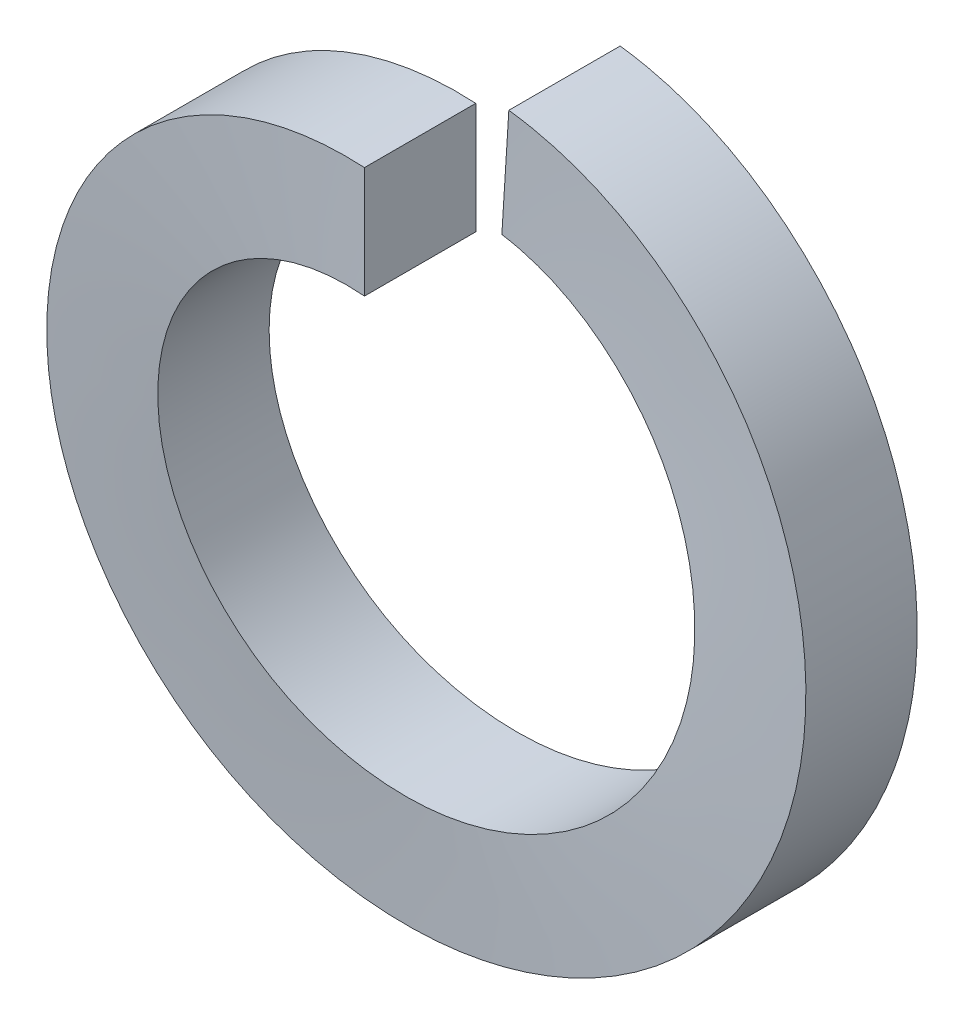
ISO-10303-21;
HEADER;
FILE_DESCRIPTION(('STEP AP214'),'2;1');
FILE_NAME('part.step','',(''),(''),'','','');
FILE_SCHEMA(('AUTOMOTIVE_DESIGN { 1 0 10303 214 1 1 1 1 }'));
ENDSEC;
DATA;
#1=APPLICATION_CONTEXT('core data for automotive mechanical design processes');
#2=APPLICATION_PROTOCOL_DEFINITION('international standard','automotive_design',2000,#1);
#3=PRODUCT_CONTEXT('',#1,'mechanical');
#4=PRODUCT('Part','Part','',(#3));
#5=PRODUCT_RELATED_PRODUCT_CATEGORY('part','',(#4));
#6=PRODUCT_DEFINITION_FORMATION('','',#4);
#7=PRODUCT_DEFINITION_CONTEXT('part definition',#1,'design');
#8=PRODUCT_DEFINITION('design','',#6,#7);
#9=PRODUCT_DEFINITION_SHAPE('','',#8);
#10=(LENGTH_UNIT() NAMED_UNIT(*) SI_UNIT(.MILLI.,.METRE.));
#11=(NAMED_UNIT(*) PLANE_ANGLE_UNIT() SI_UNIT($,.RADIAN.));
#12=(NAMED_UNIT(*) SI_UNIT($,.STERADIAN.) SOLID_ANGLE_UNIT());
#13=UNCERTAINTY_MEASURE_WITH_UNIT(LENGTH_MEASURE(1.E-05),#10,'distance_accuracy_value','');
#14=(GEOMETRIC_REPRESENTATION_CONTEXT(3) GLOBAL_UNCERTAINTY_ASSIGNED_CONTEXT((#13)) GLOBAL_UNIT_ASSIGNED_CONTEXT((#10,
#11,#12)) REPRESENTATION_CONTEXT('',''));
#15=CARTESIAN_POINT('',(0.,0.,0.));
#16=DIRECTION('',(0.,0.,1.));
#17=DIRECTION('',(1.,0.,0.));
#18=AXIS2_PLACEMENT_3D('',#15,#16,#17);
#19=CARTESIAN_POINT('',(0.,3.1369,1.1938));
#20=DIRECTION('',(1.,0.,0.));
#21=DIRECTION('',(0.,0.,-1.));
#22=AXIS2_PLACEMENT_3D('',#19,#20,#21);
#23=PLANE('',#22);
#24=CARTESIAN_POINT('',(0.,3.7338,1.1938));
#25=CARTESIAN_POINT('',(0.,2.54,1.1938));
#26=(BOUNDED_CURVE() B_SPLINE_CURVE(1,(#24,#25),.UNSPECIFIED.,.F.,
.F.) B_SPLINE_CURVE_WITH_KNOTS((2,2),(0.,1.),
.UNSPECIFIED.) CURVE() GEOMETRIC_REPRESENTATION_ITEM() RATIONAL_B_SPLINE_CURVE((1.,1.)) REPRESENTATION_ITEM(''));
#27=CARTESIAN_POINT('',(0.,3.7338,1.1938));
#28=VERTEX_POINT('',#27);
#29=CARTESIAN_POINT('',(0.,2.54,1.1938));
#30=VERTEX_POINT('',#29);
#31=EDGE_CURVE('E53',#28,#30,#26,.T.);
#32=ORIENTED_EDGE('',*,*,#31,.T.);
#33=CARTESIAN_POINT('',(0.,2.54,1.1938));
#34=CARTESIAN_POINT('',(0.,2.54,0.));
#35=(BOUNDED_CURVE() B_SPLINE_CURVE(1,(#33,#34),.UNSPECIFIED.,.F.,
.F.) B_SPLINE_CURVE_WITH_KNOTS((2,2),(0.,1.),
.UNSPECIFIED.) CURVE() GEOMETRIC_REPRESENTATION_ITEM() RATIONAL_B_SPLINE_CURVE((1.,1.)) REPRESENTATION_ITEM(''));
#36=CARTESIAN_POINT('',(0.,2.54,0.));
#37=VERTEX_POINT('',#36);
#38=EDGE_CURVE('E85',#30,#37,#35,.T.);
#39=ORIENTED_EDGE('',*,*,#38,.T.);
#40=CARTESIAN_POINT('',(0.,2.54,0.));
#41=CARTESIAN_POINT('',(0.,3.7338,0.));
#42=(BOUNDED_CURVE() B_SPLINE_CURVE(1,(#40,#41),.UNSPECIFIED.,.F.,
.F.) B_SPLINE_CURVE_WITH_KNOTS((2,2),(0.,1.),
.UNSPECIFIED.) CURVE() GEOMETRIC_REPRESENTATION_ITEM() RATIONAL_B_SPLINE_CURVE((1.,1.)) REPRESENTATION_ITEM(''));
#43=CARTESIAN_POINT('',(0.,3.7338,0.));
#44=VERTEX_POINT('',#43);
#45=EDGE_CURVE('E88',#37,#44,#42,.T.);
#46=ORIENTED_EDGE('',*,*,#45,.T.);
#47=CARTESIAN_POINT('',(0.,3.7338,0.));
#48=CARTESIAN_POINT('',(0.,3.7338,1.1938));
#49=(BOUNDED_CURVE() B_SPLINE_CURVE(1,(#47,#48),.UNSPECIFIED.,.F.,
.F.) B_SPLINE_CURVE_WITH_KNOTS((2,2),(0.,1.),
.UNSPECIFIED.) CURVE() GEOMETRIC_REPRESENTATION_ITEM() RATIONAL_B_SPLINE_CURVE((1.,1.)) REPRESENTATION_ITEM(''));
#50=EDGE_CURVE('E68',#44,#28,#49,.T.);
#51=ORIENTED_EDGE('',*,*,#50,.T.);
#52=EDGE_LOOP('',(#32,#39,#46,#51));
#53=FACE_BOUND('',#52,.T.);
#54=ADVANCED_FACE('F42',(#53),#23,.T.);
#55=CARTESIAN_POINT('',(0.17824990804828,2.83284757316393,-0.119912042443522));
#56=DIRECTION('',(0.998026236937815,-0.0627983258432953,2.55934345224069E-05));
#57=DIRECTION('',(0.0627983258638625,0.998026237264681,0.));
#58=AXIS2_PLACEMENT_3D('',#55,#56,#57);
#59=PLANE('',#58);
#60=CARTESIAN_POINT('',(0.23447638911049,3.72643036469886,-0.119912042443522));
#61=CARTESIAN_POINT('',(0.159507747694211,2.53498664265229,-0.119912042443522));
#62=(BOUNDED_CURVE() B_SPLINE_CURVE(1,(#60,#61),.UNSPECIFIED.,.F.,
.F.) B_SPLINE_CURVE_WITH_KNOTS((2,2),(0.,1.),
.UNSPECIFIED.) CURVE() GEOMETRIC_REPRESENTATION_ITEM() RATIONAL_B_SPLINE_CURVE((0.988588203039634,0.988588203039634)) REPRESENTATION_ITEM(''));
#63=CARTESIAN_POINT('',(0.159519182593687,2.53498592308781,-0.119911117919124));
#64=VERTEX_POINT('',#63);
#65=CARTESIAN_POINT('',(0.234476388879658,3.72643036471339,-0.119912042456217));
#66=VERTEX_POINT('',#65);
#67=EDGE_CURVE('E12',#64,#66,#62,.F.);
#68=ORIENTED_EDGE('',*,*,#67,.T.);
#69=CARTESIAN_POINT('',(0.234476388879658,3.72643036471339,-1.31371204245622));
#70=CARTESIAN_POINT('',(0.234476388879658,3.72643036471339,-0.119912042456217));
#71=(BOUNDED_CURVE() B_SPLINE_CURVE(1,(#69,#70),.UNSPECIFIED.,.F.,
.F.) B_SPLINE_CURVE_WITH_KNOTS((2,2),(0.,1.),
.UNSPECIFIED.) CURVE() GEOMETRIC_REPRESENTATION_ITEM() RATIONAL_B_SPLINE_CURVE((0.988588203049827,0.988588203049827)) REPRESENTATION_ITEM(''));
#72=CARTESIAN_POINT('',(0.234493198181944,3.72642930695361,-1.31371111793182));
#73=VERTEX_POINT('',#72);
#74=EDGE_CURVE('E130',#66,#73,#71,.F.);
#75=ORIENTED_EDGE('',*,*,#74,.T.);
#76=CARTESIAN_POINT('',(0.159530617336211,2.53498520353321,-1.31371019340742));
#77=CARTESIAN_POINT('',(0.23451000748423,3.72642824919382,-1.31371019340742));
#78=(BOUNDED_CURVE() B_SPLINE_CURVE(1,(#76,#77),.UNSPECIFIED.,.F.,
.F.) B_SPLINE_CURVE_WITH_KNOTS((2,2),(0.,1.),
.UNSPECIFIED.) CURVE() GEOMETRIC_REPRESENTATION_ITEM() RATIONAL_B_SPLINE_CURVE((0.988586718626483,0.988586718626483)) REPRESENTATION_ITEM(''));
#79=CARTESIAN_POINT('',(0.159530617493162,2.53498520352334,-1.31371019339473));
#80=VERTEX_POINT('',#79);
#81=EDGE_CURVE('E108',#73,#80,#78,.F.);
#82=ORIENTED_EDGE('',*,*,#81,.T.);
#83=CARTESIAN_POINT('',(0.159530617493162,2.53498520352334,-0.119910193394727));
#84=CARTESIAN_POINT('',(0.159530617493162,2.53498520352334,-1.31371019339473));
#85=(BOUNDED_CURVE() B_SPLINE_CURVE(1,(#83,#84),.UNSPECIFIED.,.F.,
.F.) B_SPLINE_CURVE_WITH_KNOTS((2,2),(0.,1.),
.UNSPECIFIED.) CURVE() GEOMETRIC_REPRESENTATION_ITEM() RATIONAL_B_SPLINE_CURVE((0.988586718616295,0.988586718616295)) REPRESENTATION_ITEM(''));
#86=EDGE_CURVE('E93',#80,#64,#85,.F.);
#87=ORIENTED_EDGE('',*,*,#86,.T.);
#88=EDGE_LOOP('',(#68,#75,#82,#87));
#89=FACE_BOUND('',#88,.T.);
#90=ADVANCED_FACE('F44',(#89),#59,.F.);
#91=CARTESIAN_POINT('',(0.,3.7338,1.1938));
#92=CARTESIAN_POINT('',(-1.54659059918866,3.7338,1.11089722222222));
#93=CARTESIAN_POINT('',(-2.64019529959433,2.64019529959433,1.02799444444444));
#94=CARTESIAN_POINT('',(-3.7338,1.54659059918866,0.945091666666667));
#95=CARTESIAN_POINT('',(-3.7338,0.,0.862188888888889));
#96=CARTESIAN_POINT('',(-3.7338,-1.54659059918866,0.779286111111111));
#97=CARTESIAN_POINT('',(-2.64019529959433,-2.64019529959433,0.696383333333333));
#98=CARTESIAN_POINT('',(-1.54659059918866,-3.7338,0.613480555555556));
#99=CARTESIAN_POINT('',(0.,-3.7338,0.530577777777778));
#100=CARTESIAN_POINT('',(1.54659059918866,-3.7338,0.447675));
#101=CARTESIAN_POINT('',(2.64019529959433,-2.64019529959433,0.364772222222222));
#102=CARTESIAN_POINT('',(3.7338,-1.54659059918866,0.281869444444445));
#103=CARTESIAN_POINT('',(3.7338,0.,0.198966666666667));
#104=CARTESIAN_POINT('',(3.7338,1.54659059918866,0.116063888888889));
#105=CARTESIAN_POINT('',(2.64019529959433,2.64019529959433,0.0331611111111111));
#106=CARTESIAN_POINT('',(1.64256043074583,3.63783016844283,-0.0424664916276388));
#107=CARTESIAN_POINT('',(0.23447638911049,3.72643036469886,-0.119912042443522));
#108=CARTESIAN_POINT('',(0.,2.54,1.1938));
#109=CARTESIAN_POINT('',(-1.05210244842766,2.54,1.11089722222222));
#110=CARTESIAN_POINT('',(-1.79605122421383,1.79605122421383,1.02799444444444));
#111=CARTESIAN_POINT('',(-2.54,1.05210244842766,0.945091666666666));
#112=CARTESIAN_POINT('',(-2.54,0.,0.862188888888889));
#113=CARTESIAN_POINT('',(-2.54,-1.05210244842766,0.779286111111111));
#114=CARTESIAN_POINT('',(-1.79605122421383,-1.79605122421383,0.696383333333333));
#115=CARTESIAN_POINT('',(-1.05210244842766,-2.54,0.613480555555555));
#116=CARTESIAN_POINT('',(0.,-2.54,0.530577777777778));
#117=CARTESIAN_POINT('',(1.05210244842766,-2.54,0.447675));
#118=CARTESIAN_POINT('',(1.79605122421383,-1.79605122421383,0.364772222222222));
#119=CARTESIAN_POINT('',(2.54,-1.05210244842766,0.281869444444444));
#120=CARTESIAN_POINT('',(2.54,0.,0.198966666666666));
#121=CARTESIAN_POINT('',(2.54,1.05210244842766,0.116063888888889));
#122=CARTESIAN_POINT('',(1.79605122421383,1.79605122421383,0.0331611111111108));
#123=CARTESIAN_POINT('',(1.11738804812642,2.47471440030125,-0.0424664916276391));
#124=CARTESIAN_POINT('',(0.159507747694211,2.53498664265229,-0.119912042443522));
#125=(BOUNDED_SURFACE() B_SPLINE_SURFACE(1,2,((#91,#92,#93,#94,#95,#96,#97,#98,#99,#100,#101,
#102,#103,#104,#105,#106,#107),(#108,#109,#110,#111,#112,#113,#114,#115,#116,#117,#118,#119,
#120,#121,#122,#123,#124)),.UNSPECIFIED.,.F.,.F.,.F.) B_SPLINE_SURFACE_WITH_KNOTS((2,2),(3,2,2,
2,2,2,2,2,3),(0.,1.),(0.,0.125,0.25,0.375,0.5,0.625,0.75,0.875,0.989797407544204),
.UNSPECIFIED.) GEOMETRIC_REPRESENTATION_ITEM() RATIONAL_B_SPLINE_SURFACE(((1.,0.923879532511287,
1.,0.923879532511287,1.,0.923879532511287,1.,0.923879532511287,1.,0.923879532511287,1.,
0.923879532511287,1.,0.923879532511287,1.,0.930092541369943,0.988588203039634),(1.,
0.923879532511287,1.,0.923879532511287,1.,0.923879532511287,1.,0.923879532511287,1.,
0.923879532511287,1.,0.923879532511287,1.,0.923879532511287,1.,0.930092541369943,0.988588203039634))) REPRESENTATION_ITEM('') SURFACE());
#126=CARTESIAN_POINT('',(0.,3.7338,1.1938));
#127=CARTESIAN_POINT('',(-1.54659059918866,3.7338,1.11089722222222));
#128=CARTESIAN_POINT('',(-2.64019529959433,2.64019529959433,1.02799444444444));
#129=CARTESIAN_POINT('',(-3.7338,1.54659059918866,0.945091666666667));
#130=CARTESIAN_POINT('',(-3.7338,0.,0.862188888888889));
#131=CARTESIAN_POINT('',(-3.7338,-1.54659059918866,0.779286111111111));
#132=CARTESIAN_POINT('',(-2.64019529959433,-2.64019529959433,0.696383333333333));
#133=CARTESIAN_POINT('',(-1.54659059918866,-3.7338,0.613480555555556));
#134=CARTESIAN_POINT('',(0.,-3.7338,0.530577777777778));
#135=CARTESIAN_POINT('',(1.54659059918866,-3.7338,0.447675));
#136=CARTESIAN_POINT('',(2.64019529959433,-2.64019529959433,0.364772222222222));
#137=CARTESIAN_POINT('',(3.7338,-1.54659059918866,0.281869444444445));
#138=CARTESIAN_POINT('',(3.7338,0.,0.198966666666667));
#139=CARTESIAN_POINT('',(3.7338,1.54659059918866,0.116063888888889));
#140=CARTESIAN_POINT('',(2.64019529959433,2.64019529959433,0.0331611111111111));
#141=CARTESIAN_POINT('',(1.64256043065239,3.63783016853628,-0.0424664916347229));
#142=CARTESIAN_POINT('',(0.234476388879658,3.72643036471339,-0.119912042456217));
#143=(BOUNDED_CURVE() B_SPLINE_CURVE(2,(#126,#127,#128,#129,#130,#131,#132,#133,#134,#135,#136,
#137,#138,#139,#140,#141,#142),.UNSPECIFIED.,.F.,.F.) B_SPLINE_CURVE_WITH_KNOTS((3,2,2,2,2,2,2,
2,3),(0.,0.125,0.25,0.375,0.5,0.625,0.75,0.875,0.989797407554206),
.UNSPECIFIED.) CURVE() GEOMETRIC_REPRESENTATION_ITEM() RATIONAL_B_SPLINE_CURVE((1.,
0.923879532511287,1.,0.923879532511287,1.,0.923879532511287,1.,0.923879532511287,1.,
0.923879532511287,1.,0.923879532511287,1.,0.923879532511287,1.,0.930092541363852,0.988588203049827)) REPRESENTATION_ITEM(''));
#144=EDGE_CURVE('E60',#28,#66,#143,.T.);
#145=CARTESIAN_POINT('',(0.,2.54,1.1938));
#146=CARTESIAN_POINT('',(-0.0357796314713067,2.54000047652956,1.19098067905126));
#147=CARTESIAN_POINT('',(-0.0715572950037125,2.53924400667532,1.18813680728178));
#148=CARTESIAN_POINT('',(-0.14331818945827,2.53620952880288,1.1823832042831));
#149=CARTESIAN_POINT('',(-0.179300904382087,2.53391994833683,1.17947313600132));
#150=CARTESIAN_POINT('',(-0.251375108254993,2.52779105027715,1.17359384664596));
#151=CARTESIAN_POINT('',(-0.287465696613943,2.52394139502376,1.17062435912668));
#152=CARTESIAN_POINT('',(-0.359655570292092,2.51467290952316,1.16463348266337));
#153=CARTESIAN_POINT('',(-0.395753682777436,2.50924507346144,1.16161189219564));
#154=CARTESIAN_POINT('',(-0.467856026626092,2.49680909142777,1.15552452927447));
#155=CARTESIAN_POINT('',(-0.503858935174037,2.48979334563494,1.15245861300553));
#156=CARTESIAN_POINT('',(-0.575666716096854,2.47417929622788,1.14629073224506));
#157=CARTESIAN_POINT('',(-0.61147024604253,2.46557485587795,1.14318867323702));
#158=CARTESIAN_POINT('',(-0.682774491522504,2.44679021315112,1.13695698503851));
#159=CARTESIAN_POINT('',(-0.718273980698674,2.43660537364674,1.13382730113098));
#160=CARTESIAN_POINT('',(-0.788865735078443,2.4146758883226,1.12754911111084));
#161=CARTESIAN_POINT('',(-0.823957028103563,2.40292812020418,1.12440057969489));
#162=CARTESIAN_POINT('',(-0.893629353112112,2.37789785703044,1.11809363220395));
#163=CARTESIAN_POINT('',(-0.928209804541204,2.36461374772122,1.11493520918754));
#164=CARTESIAN_POINT('',(-0.996759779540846,2.33654484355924,1.10861752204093));
#165=CARTESIAN_POINT('',(-1.0307292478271,2.32175991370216,1.10545825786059));
#166=CARTESIAN_POINT('',(-1.09795993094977,2.29073207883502,1.09914795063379));
#167=CARTESIAN_POINT('',(-1.13122174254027,2.27449046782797,1.09599690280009));
#168=CARTESIAN_POINT('',(-1.19694405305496,2.24060023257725,1.08971202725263));
#169=CARTESIAN_POINT('',(-1.22940591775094,2.22295426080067,1.08657817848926));
#170=CARTESIAN_POINT('',(-1.29344040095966,2.18631398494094,1.08033653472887));
#171=CARTESIAN_POINT('',(-1.32501525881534,2.16732360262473,1.07722869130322));
#172=CARTESIAN_POINT('',(-1.387193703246,2.12806026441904,1.0710477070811));
#173=CARTESIAN_POINT('',(-1.4178004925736,2.10779239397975,1.06797447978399));
#174=CARTESIAN_POINT('',(-1.4779673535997,2.06604620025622,1.06187088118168));
#175=CARTESIAN_POINT('',(-1.50753166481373,2.04457400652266,1.05884037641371));
#176=CARTESIAN_POINT('',(-1.5655453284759,2.00049680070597,1.05283067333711));
#177=CARTESIAN_POINT('',(-1.59400001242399,1.97789883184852,1.0498512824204));
#178=CARTESIAN_POINT('',(-1.64973366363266,1.93165253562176,1.04394929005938));
#179=CARTESIAN_POINT('',(-1.67701909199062,1.9080120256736,1.04102644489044));
#180=CARTESIAN_POINT('',(-1.73036197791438,1.85976640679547,1.03525183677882));
#181=CARTESIAN_POINT('',(-1.75642704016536,1.83516974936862,1.03239970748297));
#182=CARTESIAN_POINT('',(-1.80742591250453,1.78496175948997,1.02673001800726));
#183=CARTESIAN_POINT('',(-1.83236257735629,1.75935333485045,1.02391238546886));
#184=CARTESIAN_POINT('',(-1.88131292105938,1.70691473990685,1.01819313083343));
#185=CARTESIAN_POINT('',(-1.90531826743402,1.68007684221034,1.0152910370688));
#186=CARTESIAN_POINT('',(-1.95232650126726,1.62521843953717,1.0094312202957));
#187=CARTESIAN_POINT('',(-1.9753213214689,1.59719104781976,1.00647325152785));
#188=CARTESIAN_POINT('',(-2.02022284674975,1.54000943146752,1.00050272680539));
#189=CARTESIAN_POINT('',(-2.04212220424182,1.51084945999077,0.997489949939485));
#190=CARTESIAN_POINT('',(-2.08475166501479,1.4514658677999,0.991419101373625));
#191=CARTESIAN_POINT('',(-2.10547528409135,1.42123760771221,0.988360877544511));
#192=CARTESIAN_POINT('',(-2.1456769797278,1.35978818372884,0.982206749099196));
#193=CARTESIAN_POINT('',(-2.16514956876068,1.32856344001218,0.97911074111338));
#194=CARTESIAN_POINT('',(-2.20277876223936,1.26519871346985,0.972889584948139));
#195=CARTESIAN_POINT('',(-2.22093099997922,1.23305614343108,0.969764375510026));
#196=CARTESIAN_POINT('',(-2.25585563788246,1.16793977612,0.963493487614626));
#197=CARTESIAN_POINT('',(-2.27262490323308,1.13496430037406,0.960347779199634));
#198=CARTESIAN_POINT('',(-2.30472704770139,1.06827175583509,0.954044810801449));
#199=CARTESIAN_POINT('',(-2.32005811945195,1.03455381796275,0.950887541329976));
#200=CARTESIAN_POINT('',(-2.34923523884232,0.966470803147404,0.944570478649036));
#201=CARTESIAN_POINT('',(-2.36308088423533,0.932105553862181,0.94141068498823));
#202=CARTESIAN_POINT('',(-2.38924692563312,0.862826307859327,0.935097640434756));
#203=CARTESIAN_POINT('',(-2.40156838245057,0.827912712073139,0.931944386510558));
#204=CARTESIAN_POINT('',(-2.42465461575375,0.75763816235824,0.925653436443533));
#205=CARTESIAN_POINT('',(-2.43542195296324,0.722278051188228,0.922515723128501));
#206=CARTESIAN_POINT('',(-2.45537756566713,0.651213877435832,0.916264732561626));
#207=CARTESIAN_POINT('',(-2.4645699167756,0.615510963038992,0.913151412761));
#208=CARTESIAN_POINT('',(-2.481362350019,0.543865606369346,0.90695787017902));
#209=CARTESIAN_POINT('',(-2.48896801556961,0.507924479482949,0.903877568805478));
#210=CARTESIAN_POINT('',(-2.50258303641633,0.435907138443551,0.897758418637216));
#211=CARTESIAN_POINT('',(-2.50859945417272,0.399832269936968,0.894719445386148));
#212=CARTESIAN_POINT('',(-2.51904097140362,0.327650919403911,0.888690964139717));
#213=CARTESIAN_POINT('',(-2.52347456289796,0.291545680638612,0.885701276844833));
#214=CARTESIAN_POINT('',(-2.53076418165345,0.219405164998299,0.879778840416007));
#215=CARTESIAN_POINT('',(-2.53363006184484,0.183370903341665,0.876845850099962));
#216=CARTESIAN_POINT('',(-2.53780644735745,0.111471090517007,0.871044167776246));
#217=CARTESIAN_POINT('',(-2.53912808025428,0.0756062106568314,0.868175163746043));
#218=CARTESIAN_POINT('',(-2.54024782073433,0.00402096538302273,0.862497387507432));
#219=CARTESIAN_POINT('',(-2.54005319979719,-0.0316992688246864,0.859688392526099));
#220=CARTESIAN_POINT('',(-2.53815171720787,-0.103337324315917,0.853990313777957));
#221=CARTESIAN_POINT('',(-2.53643459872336,-0.139254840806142,0.851100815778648));
#222=CARTESIAN_POINT('',(-2.53146010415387,-0.211235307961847,0.845264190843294));
#223=CARTESIAN_POINT('',(-2.52819192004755,-0.247297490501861,0.84231680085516));
#224=CARTESIAN_POINT('',(-2.5200926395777,-0.319467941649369,0.836366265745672));
#225=CARTESIAN_POINT('',(-2.51525203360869,-0.355575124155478,0.833362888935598));
#226=CARTESIAN_POINT('',(-2.50399362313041,-0.427733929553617,0.827309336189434));
#227=CARTESIAN_POINT('',(-2.49756768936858,-0.463784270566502,0.824258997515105));
#228=CARTESIAN_POINT('',(-2.48313305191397,-0.535725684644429,0.818119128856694));
#229=CARTESIAN_POINT('',(-2.47511766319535,-0.571615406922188,0.815029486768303));
#230=CARTESIAN_POINT('',(-2.45750753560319,-0.643130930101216,0.808819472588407));
#231=CARTESIAN_POINT('',(-2.44790760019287,-0.678755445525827,0.805699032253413));
#232=CARTESIAN_POINT('',(-2.42714093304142,-0.749635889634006,0.799436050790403));
#233=CARTESIAN_POINT('',(-2.41597051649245,-0.784890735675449,0.796293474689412));
#234=CARTESIAN_POINT('',(-2.39208459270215,-0.854928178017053,0.78999510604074));
#235=CARTESIAN_POINT('',(-2.37936691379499,-0.889710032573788,0.786839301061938));
#236=CARTESIAN_POINT('',(-2.35241720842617,-0.958699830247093,0.780523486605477));
#237=CARTESIAN_POINT('',(-2.33818450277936,-0.992907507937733,0.777363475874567));
#238=CARTESIAN_POINT('',(-2.30824427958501,-1.06065027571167,0.771048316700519));
#239=CARTESIAN_POINT('',(-2.29253753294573,-1.09418570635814,0.767893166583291));
#240=CARTESIAN_POINT('',(-2.25969718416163,-1.16048923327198,0.761596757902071));
#241=CARTESIAN_POINT('',(-2.24256573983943,-1.19325839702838,0.758455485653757));
#242=CARTESIAN_POINT('',(-2.20693188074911,-1.25793945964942,0.752195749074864));
#243=CARTESIAN_POINT('',(-2.18843292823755,-1.28985326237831,0.749077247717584));
#244=CARTESIAN_POINT('',(-2.15012726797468,-1.35273929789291,0.74287173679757));
#245=CARTESIAN_POINT('',(-2.13032522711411,-1.38371436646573,0.739784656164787));
#246=CARTESIAN_POINT('',(-2.08948323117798,-1.44464498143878,0.733650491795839));
#247=CARTESIAN_POINT('',(-2.06844903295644,-1.47460437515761,0.730603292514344));
#248=CARTESIAN_POINT('',(-2.02521844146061,-1.53343263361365,0.72455664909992));
#249=CARTESIAN_POINT('',(-2.00302876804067,-1.56230641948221,0.721557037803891));
#250=CARTESIAN_POINT('',(-1.95756787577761,-1.61889999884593,0.715614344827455));
#251=CARTESIAN_POINT('',(-1.93430420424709,-1.64662583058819,0.712671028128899));
#252=CARTESIAN_POINT('',(-1.88678041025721,-1.70086762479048,0.706843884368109));
#253=CARTESIAN_POINT('',(-1.86252851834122,-1.72739076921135,0.703959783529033));
#254=CARTESIAN_POINT('',(-1.81307444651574,-1.77922339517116,0.698268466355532));
#255=CARTESIAN_POINT('',(-1.78787922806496,-1.8045394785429,0.695460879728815));
#256=CARTESIAN_POINT('',(-1.73630575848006,-1.85421990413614,0.689778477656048));
#257=CARTESIAN_POINT('',(-1.70992177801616,-1.8785782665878,0.686903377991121));
#258=CARTESIAN_POINT('',(-1.65595288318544,-1.92632486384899,0.681091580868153));
#259=CARTESIAN_POINT('',(-1.62836065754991,-1.94970479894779,0.678154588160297));
#260=CARTESIAN_POINT('',(-1.57202781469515,-1.99540783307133,0.672224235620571));
#261=CARTESIAN_POINT('',(-1.54328103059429,-2.01772330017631,0.66923063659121));
#262=CARTESIAN_POINT('',(-1.48469945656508,-2.06121457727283,0.663195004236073));
#263=CARTESIAN_POINT('',(-1.45485962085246,-2.08238356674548,0.660152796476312));
#264=CARTESIAN_POINT('',(-1.39415995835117,-2.12350367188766,0.654027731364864));
#265=CARTESIAN_POINT('',(-1.36329616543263,-2.14344891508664,0.650944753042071));
#266=CARTESIAN_POINT('',(-1.30062374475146,-2.18204882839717,0.644746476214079));
#267=CARTESIAN_POINT('',(-1.26881217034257,-2.20069870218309,0.641631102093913));
#268=CARTESIAN_POINT('',(-1.20432592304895,-2.23664148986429,0.635376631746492));
#269=CARTESIAN_POINT('',(-1.17164924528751,-2.25393079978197,0.63223749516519));
#270=CARTESIAN_POINT('',(-1.1055204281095,-2.28709312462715,0.625944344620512));
#271=CARTESIAN_POINT('',(-1.07206713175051,-2.30296382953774,0.62279031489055));
#272=CARTESIAN_POINT('',(-1.00447784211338,-2.33323730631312,0.61647637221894));
#273=CARTESIAN_POINT('',(-0.970341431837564,-2.34763914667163,0.613316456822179));
#274=CARTESIAN_POINT('',(-0.901482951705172,-2.37493149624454,0.60699980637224));
#275=CARTESIAN_POINT('',(-0.86676108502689,-2.38782251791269,0.60384307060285));
#276=CARTESIAN_POINT('',(-0.796832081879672,-2.41205849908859,0.597541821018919));
#277=CARTESIAN_POINT('',(-0.761625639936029,-2.4234054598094,0.594397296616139));
#278=CARTESIAN_POINT('',(-0.690830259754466,-2.44452755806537,0.58812941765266));
#279=CARTESIAN_POINT('',(-0.655242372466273,-2.45430620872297,0.585006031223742));
#280=CARTESIAN_POINT('',(-0.58378826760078,-2.47227506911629,0.578789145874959));
#281=CARTESIAN_POINT('',(-0.547923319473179,-2.4804703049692,0.575695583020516));
#282=CARTESIAN_POINT('',(-0.476019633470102,-2.49526490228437,0.569546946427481));
#283=CARTESIAN_POINT('',(-0.439982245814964,-2.50187078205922,0.566491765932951));
#284=CARTESIAN_POINT('',(-0.367837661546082,-2.51348833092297,0.560427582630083));
#285=CARTESIAN_POINT('',(-0.331731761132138,-2.51850796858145,0.55741842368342));
#286=CARTESIAN_POINT('',(-0.259552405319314,-2.52696357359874,0.551455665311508));
#287=CARTESIAN_POINT('',(-0.223480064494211,-2.53040889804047,0.548501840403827));
#288=CARTESIAN_POINT('',(-0.151468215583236,-2.53573498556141,0.542650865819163));
#289=CARTESIAN_POINT('',(-0.115529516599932,-2.53762641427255,0.539753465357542));
#290=CARTESIAN_POINT('',(-0.0438597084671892,-2.53987249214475,0.534043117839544));
#291=CARTESIAN_POINT('',(-0.00812898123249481,-2.54023817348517,0.531229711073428));
#292=CARTESIAN_POINT('',(0.0634416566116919,-2.53946068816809,0.525557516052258));
#293=CARTESIAN_POINT('',(0.0992814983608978,-2.5383120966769,0.522698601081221));
#294=CARTESIAN_POINT('',(0.171141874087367,-2.53448508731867,0.516913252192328));
#295=CARTESIAN_POINT('',(0.207161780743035,-2.53179540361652,0.513986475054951));
#296=CARTESIAN_POINT('',(0.279284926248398,-2.52486057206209,0.508076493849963));
#297=CARTESIAN_POINT('',(0.315387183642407,-2.52060542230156,0.505093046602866));
#298=CARTESIAN_POINT('',(0.387574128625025,-2.51052222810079,0.499075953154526));
#299=CARTESIAN_POINT('',(0.423657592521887,-2.50468553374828,0.496042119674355));
#300=CARTESIAN_POINT('',(0.495703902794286,-2.49143040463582,0.489932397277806));
#301=CARTESIAN_POINT('',(0.531665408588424,-2.48400474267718,0.486856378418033));
#302=CARTESIAN_POINT('',(0.60336338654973,-2.4675717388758,0.480670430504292));
#303=CARTESIAN_POINT('',(0.639098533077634,-2.45855864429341,0.477560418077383));
#304=CARTESIAN_POINT('',(0.710239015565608,-2.43895993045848,0.471315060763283));
#305=CARTESIAN_POINT('',(0.745643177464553,-2.42837006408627,0.4681796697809));
#306=CARTESIAN_POINT('',(0.816017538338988,-2.40563612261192,0.461892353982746));
#307=CARTESIAN_POINT('',(0.850986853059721,-2.39348931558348,0.458740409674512));
#308=CARTESIAN_POINT('',(0.920388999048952,-2.36766890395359,0.452428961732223));
#309=CARTESIAN_POINT('',(0.954821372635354,-2.35399407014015,0.449269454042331));
#310=CARTESIAN_POINT('',(1.02304973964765,-2.32515391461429,0.442951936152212));
#311=CARTESIAN_POINT('',(1.05684583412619,-2.30998883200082,0.439793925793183));
#312=CARTESIAN_POINT('',(1.12370533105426,-2.27821306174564,0.433488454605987));
#313=CARTESIAN_POINT('',(1.15676951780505,-2.261604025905,0.430340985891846));
#314=CARTESIAN_POINT('',(1.22207338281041,-2.22699335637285,0.424065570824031));
#315=CARTESIAN_POINT('',(1.25431464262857,-2.20899471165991,0.420937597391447));
#316=CARTESIAN_POINT('',(1.31788617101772,-2.17166539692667,0.414709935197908));
#317=CARTESIAN_POINT('',(1.34921891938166,-2.15233895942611,0.4116101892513));
#318=CARTESIAN_POINT('',(1.41089304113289,-2.11242152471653,0.405447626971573));
#319=CARTESIAN_POINT('',(1.44123787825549,-2.09183589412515,0.402384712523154));
#320=CARTESIAN_POINT('',(1.50086251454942,-2.04947371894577,0.396303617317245));
#321=CARTESIAN_POINT('',(1.53014683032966,-2.02770355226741,0.39328529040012));
#322=CARTESIAN_POINT('',(1.58758416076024,-1.98305117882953,0.387302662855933));
#323=CARTESIAN_POINT('',(1.61574279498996,-1.96017622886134,0.384338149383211));
#324=CARTESIAN_POINT('',(1.67086984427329,-1.9133980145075,0.378464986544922));
#325=CARTESIAN_POINT('',(1.69784501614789,-1.88950274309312,0.37555609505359));
#326=CARTESIAN_POINT('',(1.75055683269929,-1.84076866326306,0.369821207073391));
#327=CARTESIAN_POINT('',(1.77630132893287,-1.81593840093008,0.366994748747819));
#328=CARTESIAN_POINT('',(1.82674651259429,-1.76518520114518,0.361327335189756));
#329=CARTESIAN_POINT('',(1.85144599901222,-1.73926107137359,0.358486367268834));
#330=CARTESIAN_POINT('',(1.89990711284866,-1.68619508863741,0.352729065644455));
#331=CARTESIAN_POINT('',(1.92366022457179,-1.65904550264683,0.349812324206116));
#332=CARTESIAN_POINT('',(1.97014152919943,-1.60357736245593,0.343922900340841));
#333=CARTESIAN_POINT('',(1.99286182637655,-1.57525221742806,0.340949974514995));
#334=CARTESIAN_POINT('',(2.03719296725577,-1.51749064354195,0.334952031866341));
#335=CARTESIAN_POINT('',(2.05879667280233,-1.48804875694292,0.331926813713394));
#336=CARTESIAN_POINT('',(2.10081464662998,-1.42811888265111,0.325832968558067));
#337=CARTESIAN_POINT('',(2.12122267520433,-1.3976265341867,0.322764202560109));
#338=CARTESIAN_POINT('',(2.16077443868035,-1.33566831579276,0.316591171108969));
#339=CARTESIAN_POINT('',(2.17991296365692,-1.30419912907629,0.313486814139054));
#340=CARTESIAN_POINT('',(2.21685690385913,-1.24036659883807,0.307251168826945));
#341=CARTESIAN_POINT('',(2.23465825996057,-1.20800091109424,0.304119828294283));
#342=CARTESIAN_POINT('',(2.26886582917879,-1.14246091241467,0.297838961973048));
#343=CARTESIAN_POINT('',(2.28526924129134,-1.10928514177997,0.294689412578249));
#344=CARTESIAN_POINT('',(2.31662635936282,-1.04221593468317,0.288381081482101));
#345=CARTESIAN_POINT('',(2.3315786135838,-1.00832182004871,0.285222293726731));
#346=CARTESIAN_POINT('',(2.35998690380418,-0.939911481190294,0.278904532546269));
#347=CARTESIAN_POINT('',(2.37344291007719,-0.905395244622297,0.275745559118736));
#348=CARTESIAN_POINT('',(2.39882071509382,-0.835839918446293,0.269436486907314));
#349=CARTESIAN_POINT('',(2.41074395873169,-0.800801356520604,0.266286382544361));
#350=CARTESIAN_POINT('',(2.43302712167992,-0.730303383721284,0.260004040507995));
#351=CARTESIAN_POINT('',(2.44338999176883,-0.694844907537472,0.256871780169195));
#352=CARTESIAN_POINT('',(2.4625323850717,-0.623610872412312,0.250633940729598));
#353=CARTESIAN_POINT('',(2.47131637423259,-0.587836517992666,0.247528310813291));
#354=CARTESIAN_POINT('',(2.48729016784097,-0.516075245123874,0.241352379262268));
#355=CARTESIAN_POINT('',(2.49448594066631,-0.480089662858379,0.238281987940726));
#356=CARTESIAN_POINT('',(2.50728160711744,-0.408010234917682,0.232184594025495));
#357=CARTESIAN_POINT('',(2.51288893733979,-0.371917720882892,0.229157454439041));
#358=CARTESIAN_POINT('',(2.52251500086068,-0.299727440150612,0.223155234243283));
#359=CARTESIAN_POINT('',(2.52654258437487,-0.263630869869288,0.220179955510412));
#360=CARTESIAN_POINT('',(2.53302511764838,-0.191533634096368,0.214285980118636));
#361=CARTESIAN_POINT('',(2.5354902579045,-0.155533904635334,0.211367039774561));
#362=CARTESIAN_POINT('',(2.53887217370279,-0.0837274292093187,0.205603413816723));
#363=CARTESIAN_POINT('',(2.53980038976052,-0.0479212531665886,0.202758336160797));
#364=CARTESIAN_POINT('',(2.54014157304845,0.0236383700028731,0.197090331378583));
#365=CARTESIAN_POINT('',(2.53955713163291,0.0593918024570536,0.194267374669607));
#366=CARTESIAN_POINT('',(2.53686968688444,0.131109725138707,0.188538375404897));
#367=CARTESIAN_POINT('',(2.53475513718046,0.167073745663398,0.185631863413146));
#368=CARTESIAN_POINT('',(2.52897915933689,0.239122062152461,0.179763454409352));
#369=CARTESIAN_POINT('',(2.52530724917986,0.275205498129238,0.176801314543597));
#370=CARTESIAN_POINT('',(2.51639601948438,0.347392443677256,0.170823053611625));
#371=CARTESIAN_POINT('',(2.51114753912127,0.383494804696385,0.16780671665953));
#372=CARTESIAN_POINT('',(2.4990710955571,0.455617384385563,0.161729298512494));
#373=CARTESIAN_POINT('',(2.49223537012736,0.491636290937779,0.158668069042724));
#374=CARTESIAN_POINT('',(2.47698116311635,0.563487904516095,0.152508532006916));
#375=CARTESIAN_POINT('',(2.46855637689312,0.599319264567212,0.149410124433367));
#376=CARTESIAN_POINT('',(2.45012981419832,0.670691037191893,0.143184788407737));
#377=CARTESIAN_POINT('',(2.44012322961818,0.706230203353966,0.140057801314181));
#378=CARTESIAN_POINT('',(2.41854798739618,0.776913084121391,0.133783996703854));
#379=CARTESIAN_POINT('',(2.4069760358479,0.812055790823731,0.13063715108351));
#380=CARTESIAN_POINT('',(2.38229411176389,0.881842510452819,0.124332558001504));
#381=CARTESIAN_POINT('',(2.36918235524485,0.916485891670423,0.121174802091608));
#382=CARTESIAN_POINT('',(2.34145386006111,0.985172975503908,0.114857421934));
#383=CARTESIAN_POINT('',(2.32683682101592,1.01921655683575,0.111697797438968));
#384=CARTESIAN_POINT('',(2.29613950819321,1.08660628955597,0.105385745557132));
#385=CARTESIAN_POINT('',(2.2800603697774,1.11995295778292,0.102233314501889));
#386=CARTESIAN_POINT('',(2.24648891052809,1.18585527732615,0.0959446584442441));
#387=CARTESIAN_POINT('',(2.22899909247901,1.21841220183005,0.0928084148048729));
#388=CARTESIAN_POINT('',(2.19266411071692,1.28264647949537,0.0865609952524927));
#389=CARTESIAN_POINT('',(2.17382273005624,1.31432596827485,0.0834497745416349));
#390=CARTESIAN_POINT('',(2.13484961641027,1.37672264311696,0.0772610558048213));
#391=CARTESIAN_POINT('',(2.11472284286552,1.40744291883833,0.0741834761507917));
#392=CARTESIAN_POINT('',(2.0732503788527,1.46784494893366,0.0680703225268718));
#393=CARTESIAN_POINT('',(2.05191070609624,1.49753082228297,0.0650346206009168));
#394=CARTESIAN_POINT('',(2.00808951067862,1.55579495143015,0.0590133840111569));
#395=CARTESIAN_POINT('',(1.9856149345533,1.58437841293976,0.0560276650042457));
#396=CARTESIAN_POINT('',(1.93960583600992,1.64037614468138,0.0501131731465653));
#397=CARTESIAN_POINT('',(1.91607905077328,1.66779674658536,0.047184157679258));
#398=CARTESIAN_POINT('',(1.8680511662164,1.72141534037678,0.0413928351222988));
#399=CARTESIAN_POINT('',(1.84355845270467,1.74762080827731,0.0385301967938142));
#400=CARTESIAN_POINT('',(1.79358427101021,1.79886940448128,0.0328562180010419));
#401=CARTESIAN_POINT('',(1.76810720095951,1.82391680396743,0.030044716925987));
#402=CARTESIAN_POINT('',(1.71593747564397,1.87308640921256,0.0243390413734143));
#403=CARTESIAN_POINT('',(1.6892374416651,1.89720073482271,0.0214444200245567));
#404=CARTESIAN_POINT('',(1.6346490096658,1.94443679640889,0.0155985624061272));
#405=CARTESIAN_POINT('',(1.60675359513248,1.96755039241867,0.0126470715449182));
#406=CARTESIAN_POINT('',(1.54982925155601,2.01269894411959,0.00668872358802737));
#407=CARTESIAN_POINT('',(1.52079444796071,2.03472646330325,0.00368163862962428));
#408=CARTESIAN_POINT('',(1.46165364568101,2.07762121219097,-0.00237872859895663));
#409=CARTESIAN_POINT('',(1.43154288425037,2.09848185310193,-0.00543216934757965));
#410=CARTESIAN_POINT('',(1.37032008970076,2.13896595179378,-0.0115776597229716));
#411=CARTESIAN_POINT('',(1.33920435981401,2.15858380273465,-0.0146698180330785));
#412=CARTESIAN_POINT('',(1.27604853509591,2.19651118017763,-0.0208842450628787));
#413=CARTESIAN_POINT('',(1.24400574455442,2.2148162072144,-0.0240065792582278));
#414=CARTESIAN_POINT('',(1.17907912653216,2.25005329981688,-0.0302727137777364));
#415=CARTESIAN_POINT('',(1.14619352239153,2.26698208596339,-0.0334165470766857));
#416=CARTESIAN_POINT('',(1.07967031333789,2.29940928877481,-0.0397167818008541));
#417=CARTESIAN_POINT('',(1.04603175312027,2.31490574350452,-0.0428731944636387));
#418=CARTESIAN_POINT('',(0.978096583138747,2.34441872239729,-0.0491895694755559));
#419=CARTESIAN_POINT('',(0.943799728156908,2.35843468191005,-0.0523495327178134));
#420=CARTESIAN_POINT('',(0.874645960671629,2.38494547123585,-0.0586639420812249));
#421=CARTESIAN_POINT('',(0.839789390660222,2.3974411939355,-0.0618183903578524));
#422=CARTESIAN_POINT('',(0.769617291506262,2.42087906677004,-0.0681127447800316));
#423=CARTESIAN_POINT('',(0.734302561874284,2.43182360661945,-0.0712526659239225));
#424=CARTESIAN_POINT('',(0.663317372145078,2.45213570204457,-0.0775090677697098));
#425=CARTESIAN_POINT('',(0.6276480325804,2.4615071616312,-0.0806255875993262));
#426=CARTESIAN_POINT('',(0.556057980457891,2.478658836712,-0.0868264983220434));
#427=CARTESIAN_POINT('',(0.520138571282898,2.48644446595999,-0.0899109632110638));
#428=CARTESIAN_POINT('',(0.448152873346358,2.50041944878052,-0.09603936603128));
#429=CARTESIAN_POINT('',(0.412087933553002,2.50661569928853,-0.0990834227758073));
#430=CARTESIAN_POINT('',(0.339914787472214,2.51741574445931,-0.105122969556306));
#431=CARTESIAN_POINT('',(0.303807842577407,2.52202787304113,-0.108118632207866));
#432=CARTESIAN_POINT('',(0.231652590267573,2.52967304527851,-0.114053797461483));
#433=CARTESIAN_POINT('',(0.195605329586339,2.53271578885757,-0.116993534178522));
#434=CARTESIAN_POINT('',(0.159507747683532,2.53498664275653,-0.119912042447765));
#435=B_SPLINE_CURVE_WITH_KNOTS('',3,(#145,#146,#147,#148,#149,#150,#151,#152,#153,#154,#155,
#156,#157,#158,#159,#160,#161,#162,#163,#164,#165,#166,#167,#168,#169,#170,#171,#172,#173,#174,
#175,#176,#177,#178,#179,#180,#181,#182,#183,#184,#185,#186,#187,#188,#189,#190,#191,#192,#193,
#194,#195,#196,#197,#198,#199,#200,#201,#202,#203,#204,#205,#206,#207,#208,#209,#210,#211,#212,
#213,#214,#215,#216,#217,#218,#219,#220,#221,#222,#223,#224,#225,#226,#227,#228,#229,#230,#231,
#232,#233,#234,#235,#236,#237,#238,#239,#240,#241,#242,#243,#244,#245,#246,#247,#248,#249,#250,
#251,#252,#253,#254,#255,#256,#257,#258,#259,#260,#261,#262,#263,#264,#265,#266,#267,#268,#269,
#270,#271,#272,#273,#274,#275,#276,#277,#278,#279,#280,#281,#282,#283,#284,#285,#286,#287,#288,
#289,#290,#291,#292,#293,#294,#295,#296,#297,#298,#299,#300,#301,#302,#303,#304,#305,#306,#307,
#308,#309,#310,#311,#312,#313,#314,#315,#316,#317,#318,#319,#320,#321,#322,#323,#324,#325,#326,
#327,#328,#329,#330,#331,#332,#333,#334,#335,#336,#337,#338,#339,#340,#341,#342,#343,#344,#345,
#346,#347,#348,#349,#350,#351,#352,#353,#354,#355,#356,#357,#358,#359,#360,#361,#362,#363,#364,
#365,#366,#367,#368,#369,#370,#371,#372,#373,#374,#375,#376,#377,#378,#379,#380,#381,#382,#383,
#384,#385,#386,#387,#388,#389,#390,#391,#392,#393,#394,#395,#396,#397,#398,#399,#400,#401,#402,
#403,#404,#405,#406,#407,#408,#409,#410,#411,#412,#413,#414,#415,#416,#417,#418,#419,#420,#421,
#422,#423,#424,#425,#426,#427,#428,#429,#430,#431,#432,#433,#434),.UNSPECIFIED.,.F.,.F.,(4,2,2,
2,2,2,2,2,2,2,2,2,2,2,2,2,2,2,2,2,2,2,2,2,2,2,2,2,2,2,2,2,2,2,2,2,2,2,2,2,2,2,2,2,2,2,2,2,2,2,2,
2,2,2,2,2,2,2,2,2,2,2,2,2,2,2,2,2,2,2,2,2,2,2,2,2,2,2,2,2,2,2,2,2,2,2,2,2,2,2,2,2,2,2,2,2,2,2,2,
2,2,2,2,2,2,2,2,2,2,2,2,2,2,2,2,2,2,2,2,2,2,2,2,2,2,2,2,2,2,2,2,2,2,2,2,2,2,2,2,2,2,2,2,2,4),
(0.,0.107663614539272,0.216149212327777,0.325365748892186,0.435218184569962,0.545607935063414,
0.656433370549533,0.767590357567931,0.878972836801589,0.99047342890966,1.10198405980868,
1.21339659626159,1.32460348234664,1.43549836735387,1.54597671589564,1.65593639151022,
1.76527820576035,1.87390642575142,1.9817292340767,2.0892619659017,2.19760180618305,
2.3066897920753,2.41643159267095,2.52672924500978,2.63748164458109,2.74858507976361,
2.85993380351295,2.97142063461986,3.08293758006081,3.19437646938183,3.30562959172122,
3.41659032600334,3.52715375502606,3.63721725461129,3.74668104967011,3.85544872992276,
3.96342771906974,4.07088919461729,4.1790801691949,4.28803635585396,4.39766414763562,
4.50786621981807,4.6185420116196,4.7295882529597,4.84089952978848,4.95236888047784,
5.06388841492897,5.17534994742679,5.28664563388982,5.39766860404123,5.50831357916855,
5.61847746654,5.72805992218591,5.83696387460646,5.94509600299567,6.0525458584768,
6.1605848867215,6.26940605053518,6.37891648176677,6.48901951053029,6.59961513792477,
6.71060055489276,6.82187070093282,6.93331885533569,7.04483725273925,7.15631771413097,
7.267652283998,7.3787338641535,7.48945683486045,7.59971765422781,7.70941542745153,
7.81845243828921,7.9267346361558,8.03423250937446,8.1421165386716,8.25079948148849,
8.36018922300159,8.47018976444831,8.58070168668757,8.691622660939,8.80284800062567,
8.9142712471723,9.02578478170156,9.13728045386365,9.24865021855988,9.35978677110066,
9.47058417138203,9.58093844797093,9.69074817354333,9.79991500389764,9.90834417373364,
10.0159496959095,10.1236757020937,10.2322172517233,10.3414829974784,10.4513776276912,
10.5618023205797,10.6726552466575,10.7838321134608,10.8952267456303,11.0067316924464,
11.1182388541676,11.2296401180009,11.3408279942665,11.4516962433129,11.5621404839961,
11.6720587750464,11.7813521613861,11.889925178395,11.9976863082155,12.1052629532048,
12.2136599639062,12.3227984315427,12.4325837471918,12.5429177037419,12.6536989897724,
12.7648237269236,12.8761860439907,12.9876786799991,13.0991936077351,13.2106226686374,
13.3218582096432,13.4327937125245,13.5433244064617,13.6533478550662,13.7627645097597,
13.8714782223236,13.9793967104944,14.0868788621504,14.1951282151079,14.3041361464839,
14.4138087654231,14.524048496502,14.6347545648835,14.7458235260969,14.8571498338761,
14.968626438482,15.0801454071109,15.1915985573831,15.3028780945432,15.4138772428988,
15.5244908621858,15.6346160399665,15.7441526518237,15.8530038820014),.UNSPECIFIED.);
#436=EDGE_CURVE('E102',#30,#64,#435,.T.);
#437=ORIENTED_EDGE('',*,*,#31,.F.);
#438=ORIENTED_EDGE('',*,*,#144,.T.);
#439=ORIENTED_EDGE('',*,*,#67,.F.);
#440=ORIENTED_EDGE('',*,*,#436,.F.);
#441=EDGE_LOOP('',(#437,#438,#439,#440));
#442=FACE_BOUND('',#441,.T.);
#443=ADVANCED_FACE('F199',(#442),#125,.F.);
#444=CARTESIAN_POINT('',(0.,3.7338,0.));
#445=CARTESIAN_POINT('',(-1.54659059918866,3.7338,-0.0829027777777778));
#446=CARTESIAN_POINT('',(-2.64019529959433,2.64019529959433,-0.165805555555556));
#447=CARTESIAN_POINT('',(-3.7338,1.54659059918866,-0.248708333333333));
#448=CARTESIAN_POINT('',(-3.7338,0.,-0.331611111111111));
#449=CARTESIAN_POINT('',(-3.7338,-1.54659059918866,-0.414513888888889));
#450=CARTESIAN_POINT('',(-2.64019529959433,-2.64019529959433,-0.497416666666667));
#451=CARTESIAN_POINT('',(-1.54659059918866,-3.7338,-0.580319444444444));
#452=CARTESIAN_POINT('',(0.,-3.7338,-0.663222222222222));
#453=CARTESIAN_POINT('',(1.54659059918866,-3.7338,-0.746125));
#454=CARTESIAN_POINT('',(2.64019529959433,-2.64019529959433,-0.829027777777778));
#455=CARTESIAN_POINT('',(3.7338,-1.54659059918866,-0.911930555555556));
#456=CARTESIAN_POINT('',(3.7338,0.,-0.994833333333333));
#457=CARTESIAN_POINT('',(3.7338,1.54659059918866,-1.07773611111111));
#458=CARTESIAN_POINT('',(2.64019529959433,2.64019529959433,-1.16063888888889));
#459=CARTESIAN_POINT('',(1.64256043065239,3.63783016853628,-1.23626649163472));
#460=CARTESIAN_POINT('',(0.234476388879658,3.72643036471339,-1.31371204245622));
#461=CARTESIAN_POINT('',(0.,3.7338,1.1938));
#462=CARTESIAN_POINT('',(-1.54659059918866,3.7338,1.11089722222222));
#463=CARTESIAN_POINT('',(-2.64019529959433,2.64019529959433,1.02799444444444));
#464=CARTESIAN_POINT('',(-3.7338,1.54659059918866,0.945091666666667));
#465=CARTESIAN_POINT('',(-3.7338,0.,0.862188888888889));
#466=CARTESIAN_POINT('',(-3.7338,-1.54659059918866,0.779286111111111));
#467=CARTESIAN_POINT('',(-2.64019529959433,-2.64019529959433,0.696383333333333));
#468=CARTESIAN_POINT('',(-1.54659059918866,-3.7338,0.613480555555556));
#469=CARTESIAN_POINT('',(0.,-3.7338,0.530577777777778));
#470=CARTESIAN_POINT('',(1.54659059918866,-3.7338,0.447675));
#471=CARTESIAN_POINT('',(2.64019529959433,-2.64019529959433,0.364772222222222));
#472=CARTESIAN_POINT('',(3.7338,-1.54659059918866,0.281869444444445));
#473=CARTESIAN_POINT('',(3.7338,0.,0.198966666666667));
#474=CARTESIAN_POINT('',(3.7338,1.54659059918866,0.116063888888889));
#475=CARTESIAN_POINT('',(2.64019529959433,2.64019529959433,0.0331611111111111));
#476=CARTESIAN_POINT('',(1.64256043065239,3.63783016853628,-0.0424664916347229));
#477=CARTESIAN_POINT('',(0.234476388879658,3.72643036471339,-0.119912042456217));
#478=(BOUNDED_SURFACE() B_SPLINE_SURFACE(1,2,((#444,#445,#446,#447,#448,#449,#450,#451,#452,
#453,#454,#455,#456,#457,#458,#459,#460),(#461,#462,#463,#464,#465,#466,#467,#468,#469,#470,
#471,#472,#473,#474,#475,#476,#477)),.UNSPECIFIED.,.F.,.F.,.F.) B_SPLINE_SURFACE_WITH_KNOTS((2,
2),(3,2,2,2,2,2,2,2,3),(0.,1.),(0.,0.125,0.25,0.375,0.5,0.625,0.75,0.875,0.989797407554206),
.UNSPECIFIED.) GEOMETRIC_REPRESENTATION_ITEM() RATIONAL_B_SPLINE_SURFACE(((1.,0.923879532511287,
1.,0.923879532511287,1.,0.923879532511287,1.,0.923879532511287,1.,0.923879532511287,1.,
0.923879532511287,1.,0.923879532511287,1.,0.930092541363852,0.988588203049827),(1.,
0.923879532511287,1.,0.923879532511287,1.,0.923879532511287,1.,0.923879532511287,1.,
0.923879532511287,1.,0.923879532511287,1.,0.923879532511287,1.,0.930092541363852,0.988588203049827))) REPRESENTATION_ITEM('') SURFACE());
#479=CARTESIAN_POINT('',(0.,3.7338,0.));
#480=CARTESIAN_POINT('',(-0.059197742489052,3.73380113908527,-0.00317318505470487));
#481=CARTESIAN_POINT('',(-0.118393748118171,3.7323922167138,-0.00637758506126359));
#482=CARTESIAN_POINT('',(-0.237146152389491,3.72673919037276,-0.0128686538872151));
#483=CARTESIAN_POINT('',(-0.296701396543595,3.7224713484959,-0.0161557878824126));
#484=CARTESIAN_POINT('',(-0.415968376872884,3.71104408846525,-0.0228026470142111));
#485=CARTESIAN_POINT('',(-0.47567810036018,3.7038638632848,-0.026162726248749));
#486=CARTESIAN_POINT('',(-0.595042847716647,3.68657634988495,-0.0329449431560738));
#487=CARTESIAN_POINT('',(-0.654695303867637,3.67645142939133,-0.0363673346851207));
#488=CARTESIAN_POINT('',(-0.77372919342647,3.65325888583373,-0.0432629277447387));
#489=CARTESIAN_POINT('',(-0.833107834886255,3.6401769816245,-0.0467362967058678));
#490=CARTESIAN_POINT('',(-0.95137513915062,3.6110760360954,-0.0537219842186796));
#491=CARTESIAN_POINT('',(-1.01026113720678,3.59504618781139,-0.0572343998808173));
#492=CARTESIAN_POINT('',(-1.12732414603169,3.56007637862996,-0.0642858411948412));
#493=CARTESIAN_POINT('',(-1.18549898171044,3.54112914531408,-0.0678249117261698));
#494=CARTESIAN_POINT('',(-1.30092325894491,3.50037312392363,-0.0749169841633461));
#495=CARTESIAN_POINT('',(-1.35817137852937,3.47856059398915,-0.0784699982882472));
#496=CARTESIAN_POINT('',(-1.47153106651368,3.43214369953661,-0.0855770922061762));
#497=CARTESIAN_POINT('',(-1.52764252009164,3.40753905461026,-0.0891311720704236));
#498=CARTESIAN_POINT('',(-1.63852554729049,3.35562806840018,-0.0962274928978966));
#499=CARTESIAN_POINT('',(-1.69329854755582,3.32832477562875,-0.0997697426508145));
#500=CARTESIAN_POINT('',(-1.80131160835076,3.27112593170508,-0.106829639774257));
#501=CARTESIAN_POINT('',(-1.85455494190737,3.2412365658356,-0.110347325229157));
#502=CARTESIAN_POINT('',(-1.95932812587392,3.17899284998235,-0.117345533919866));
#503=CARTESIAN_POINT('',(-2.01086336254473,3.14664757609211,-0.12082614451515));
#504=CARTESIAN_POINT('',(-2.11205430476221,3.07963540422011,-0.127738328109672));
#505=CARTESIAN_POINT('',(-2.16171773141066,3.04498018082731,-0.131170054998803));
#506=CARTESIAN_POINT('',(-2.25901524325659,2.97350549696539,-0.1379721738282));
#507=CARTESIAN_POINT('',(-2.30665955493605,2.93669998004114,-0.141342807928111));
#508=CARTESIAN_POINT('',(-2.3997864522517,2.86109407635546,-0.148014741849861));
#509=CARTESIAN_POINT('',(-2.44528188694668,2.82230954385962,-0.151316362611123));
#510=CARTESIAN_POINT('',(-2.53399773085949,2.74292400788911,-0.157829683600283));
#511=CARTESIAN_POINT('',(-2.57723366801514,2.70234039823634,-0.161041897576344));
#512=CARTESIAN_POINT('',(-2.66161182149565,2.61927098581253,-0.16742698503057));
#513=CARTESIAN_POINT('',(-2.70275934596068,2.57679058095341,-0.170599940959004));
#514=CARTESIAN_POINT('',(-2.78332229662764,2.4895649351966,-0.177051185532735));
#515=CARTESIAN_POINT('',(-2.82272043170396,2.44480377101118,-0.180330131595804));
#516=CARTESIAN_POINT('',(-2.89961283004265,2.35310744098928,-0.186956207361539));
#517=CARTESIAN_POINT('',(-2.9370906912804,2.30615854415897,-0.190303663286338));
#518=CARTESIAN_POINT('',(-3.00996600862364,2.21020797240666,-0.197064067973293));
#519=CARTESIAN_POINT('',(-3.04534884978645,2.16119521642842,-0.200477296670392));
#520=CARTESIAN_POINT('',(-3.11386832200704,2.06125593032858,-0.20735601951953));
#521=CARTESIAN_POINT('',(-3.14699249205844,2.01032086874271,-0.210821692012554));
#522=CARTESIAN_POINT('',(-3.21084138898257,1.90669306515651,-0.217794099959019));
#523=CARTESIAN_POINT('',(-3.24155614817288,1.85399418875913,-0.221300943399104));
#524=CARTESIAN_POINT('',(-3.30044784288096,1.74701033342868,-0.228343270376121));
#525=CARTESIAN_POINT('',(-3.32861760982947,1.69272141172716,-0.231878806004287));
#526=CARTESIAN_POINT('',(-3.38229769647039,1.58274275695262,-0.238965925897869));
#527=CARTESIAN_POINT('',(-3.40780390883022,1.52705102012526,-0.242517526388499));
#528=CARTESIAN_POINT('',(-3.4560536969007,1.41446364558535,-0.249623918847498));
#529=CARTESIAN_POINT('',(-3.47879643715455,1.35756764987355,-0.253178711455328));
#530=CARTESIAN_POINT('',(-3.52143587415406,1.24277797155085,-0.26027858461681));
#531=CARTESIAN_POINT('',(-3.54133516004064,1.18488525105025,-0.263823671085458));
#532=CARTESIAN_POINT('',(-3.57822506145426,1.06831514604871,-0.270891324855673));
#533=CARTESIAN_POINT('',(-3.59522178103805,1.00963969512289,-0.274413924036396));
#534=CARTESIAN_POINT('',(-3.62626532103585,0.891721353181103,-0.281424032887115));
#535=CARTESIAN_POINT('',(-3.6403217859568,0.832481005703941,-0.284911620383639));
#536=CARTESIAN_POINT('',(-3.66546521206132,0.713651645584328,-0.291839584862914));
#537=CARTESIAN_POINT('',(-3.67656531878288,0.654065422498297,-0.295280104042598));
#538=CARTESIAN_POINT('',(-3.69579788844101,0.534761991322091,-0.302102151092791));
#539=CARTESIAN_POINT('',(-3.70394689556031,0.47504746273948,-0.305483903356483));
#540=CARTESIAN_POINT('',(-3.71730004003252,0.355701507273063,-0.312178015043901));
#541=CARTESIAN_POINT('',(-3.7225239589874,0.296072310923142,-0.315490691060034));
#542=CARTESIAN_POINT('',(-3.73006976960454,0.1771049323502,-0.322034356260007));
#543=CARTESIAN_POINT('',(-3.7324144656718,0.117768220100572,-0.325265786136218));
#544=CARTESIAN_POINT('',(-3.73426729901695,-0.000664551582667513,-0.331658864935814));
#545=CARTESIAN_POINT('',(-3.73378913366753,-0.0597603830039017,-0.334820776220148));
#546=CARTESIAN_POINT('',(-3.73001484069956,-0.17831566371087,-0.341247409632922));
#547=CARTESIAN_POINT('',(-3.72669693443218,-0.237774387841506,-0.344512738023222));
#548=CARTESIAN_POINT('',(-3.71718594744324,-0.356916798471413,-0.351113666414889));
#549=CARTESIAN_POINT('',(-3.71097106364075,-0.416598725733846,-0.354449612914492));
#550=CARTESIAN_POINT('',(-3.69562378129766,-0.535978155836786,-0.361188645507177));
#551=CARTESIAN_POINT('',(-3.68647268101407,-0.595673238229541,-0.364592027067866));
#552=CARTESIAN_POINT('',(-3.665230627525,-0.714864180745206,-0.37145297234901));
#553=CARTESIAN_POINT('',(-3.65312427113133,-0.774357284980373,-0.374910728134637));
#554=CARTESIAN_POINT('',(-3.62597022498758,-0.89292587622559,-0.381869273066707));
#555=CARTESIAN_POINT('',(-3.61091057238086,-0.951998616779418,-0.385370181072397));
#556=CARTESIAN_POINT('',(-3.57786985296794,-1.06950720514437,-0.392402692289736));
#557=CARTESIAN_POINT('',(-3.55988034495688,-1.12794067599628,-0.395934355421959));
#558=CARTESIAN_POINT('',(-3.52102139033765,-1.24395316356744,-0.403015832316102));
#559=CARTESIAN_POINT('',(-3.50014704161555,-1.30153053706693,-0.406565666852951));
#560=CARTESIAN_POINT('',(-3.45558120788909,-1.41561765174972,-0.413670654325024));
#561=CARTESIAN_POINT('',(-3.43188831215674,-1.47212684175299,-0.417225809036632));
#562=CARTESIAN_POINT('',(-3.38176889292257,-1.58387139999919,-0.424328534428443));
#563=CARTESIAN_POINT('',(-3.35534433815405,-1.63910765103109,-0.42787610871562));
#564=CARTESIAN_POINT('',(-3.29986481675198,-1.7481096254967,-0.434950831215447));
#565=CARTESIAN_POINT('',(-3.27081502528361,-1.80187798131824,-0.438478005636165));
#566=CARTESIAN_POINT('',(-3.21020660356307,-1.90775925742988,-0.44549933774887));
#567=CARTESIAN_POINT('',(-3.17865612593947,-1.95987683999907,-0.448993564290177));
#568=CARTESIAN_POINT('',(-3.11318458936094,-2.06228554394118,-0.455936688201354));
#569=CARTESIAN_POINT('',(-3.07927438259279,-2.11258359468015,-0.459385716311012));
#570=CARTESIAN_POINT('',(-3.00923641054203,-2.21119787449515,-0.466226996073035));
#571=CARTESIAN_POINT('',(-2.97312187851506,-2.25952348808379,-0.469619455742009));
#572=CARTESIAN_POINT('',(-2.89884082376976,-2.35405472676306,-0.476335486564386));
#573=CARTESIAN_POINT('',(-2.86068956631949,-2.40027232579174,-0.479659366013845));
#574=CARTESIAN_POINT('',(-2.78251111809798,-2.49046749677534,-0.486231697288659));
#575=CARTESIAN_POINT('',(-2.74250085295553,-2.53445971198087,-0.48948053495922));
#576=CARTESIAN_POINT('',(-2.66068929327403,-2.62020673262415,-0.495886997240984));
#577=CARTESIAN_POINT('',(-2.61890131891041,-2.66197421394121,-0.499045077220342));
#578=CARTESIAN_POINT('',(-2.53311049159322,-2.7437472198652,-0.505452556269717));
#579=CARTESIAN_POINT('',(-2.48909480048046,-2.7837392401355,-0.508702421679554));
#580=CARTESIAN_POINT('',(-2.39885375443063,-2.86187931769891,-0.515276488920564));
#581=CARTESIAN_POINT('',(-2.35261378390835,-2.90001046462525,-0.518601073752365));
#582=CARTESIAN_POINT('',(-2.25803908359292,-2.97424949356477,-0.525318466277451));
#583=CARTESIAN_POINT('',(-2.20969240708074,-3.01034212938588,-0.528711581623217));
#584=CARTESIAN_POINT('',(-2.11103746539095,-3.08033461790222,-0.535554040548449));
#585=CARTESIAN_POINT('',(-2.06071984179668,-3.11422126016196,-0.539003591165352));
#586=CARTESIAN_POINT('',(-1.95827363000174,-3.17964411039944,-0.545947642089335));
#587=CARTESIAN_POINT('',(-1.90613813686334,-3.21116949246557,-0.549442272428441));
#588=CARTESIAN_POINT('',(-1.80022283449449,-3.27172632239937,-0.556464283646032));
#589=CARTESIAN_POINT('',(-1.74643838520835,-3.30074964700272,-0.559991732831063));
#590=CARTESIAN_POINT('',(-1.63740615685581,-3.35617500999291,-0.567066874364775));
#591=CARTESIAN_POINT('',(-1.5821557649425,-3.3825719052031,-0.570614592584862));
#592=CARTESIAN_POINT('',(-1.47038497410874,-3.43263497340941,-0.57771747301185));
#593=CARTESIAN_POINT('',(-1.41386370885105,-3.45629921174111,-0.581272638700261));
#594=CARTESIAN_POINT('',(-1.29975458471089,-3.50080690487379,-0.588377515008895));
#595=CARTESIAN_POINT('',(-1.2421672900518,-3.52165180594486,-0.591927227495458));
#596=CARTESIAN_POINT('',(-1.1261371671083,-3.56045125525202,-0.599008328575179));
#597=CARTESIAN_POINT('',(-1.06769599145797,-3.57841074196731,-0.602539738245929));
#598=CARTESIAN_POINT('',(-0.950174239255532,-3.61139103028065,-0.609571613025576));
#599=CARTESIAN_POINT('',(-0.891096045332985,-3.62642030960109,-0.613072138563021));
#600=CARTESIAN_POINT('',(-0.772518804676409,-3.65351344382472,-0.620029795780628));
#601=CARTESIAN_POINT('',(-0.713022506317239,-3.66558929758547,-0.623487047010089));
#602=CARTESIAN_POINT('',(-0.593827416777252,-3.68677040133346,-0.63034685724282));
#603=CARTESIAN_POINT('',(-0.534131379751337,-3.69589108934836,-0.63374960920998));
#604=CARTESIAN_POINT('',(-0.414752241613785,-3.71117781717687,-0.640487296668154));
#605=CARTESIAN_POINT('',(-0.355071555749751,-3.71736259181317,-0.64382252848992));
#606=CARTESIAN_POINT('',(-0.23593375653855,-3.72681383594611,-0.650421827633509));
#607=CARTESIAN_POINT('',(-0.176478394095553,-3.73010213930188,-0.653686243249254));
#608=CARTESIAN_POINT('',(-0.0579280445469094,-3.73381798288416,-0.660111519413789));
#609=CARTESIAN_POINT('',(0.0011662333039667,-3.73426714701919,-0.663272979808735));
#610=CARTESIAN_POINT('',(0.119601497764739,-3.73235625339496,-0.669666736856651));
#611=CARTESIAN_POINT('',(0.178942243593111,-3.7299821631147,-0.672899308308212));
#612=CARTESIAN_POINT('',(0.297915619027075,-3.72237696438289,-0.679444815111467));
#613=CARTESIAN_POINT('',(0.357546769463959,-3.71712308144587,-0.682758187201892));
#614=CARTESIAN_POINT('',(0.476894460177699,-3.70370960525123,-0.689453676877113));
#615=CARTESIAN_POINT('',(0.536608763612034,-3.69553026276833,-0.69283611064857));
#616=CARTESIAN_POINT('',(0.655909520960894,-3.67623682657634,-0.699659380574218));
#617=CARTESIAN_POINT('',(0.715493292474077,-3.66510622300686,-0.70310044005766));
#618=CARTESIAN_POINT('',(0.834315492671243,-3.63990182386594,-0.710029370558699));
#619=CARTESIAN_POINT('',(0.893551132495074,-3.62581491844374,-0.713517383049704));
#620=CARTESIAN_POINT('',(1.01145779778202,-3.5947107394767,-0.720528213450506));
#621=CARTESIAN_POINT('',(1.07012628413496,-3.57768385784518,-0.724051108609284));
#622=CARTESIAN_POINT('',(1.18668022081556,-3.54073409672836,-0.73111922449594));
#623=CARTESIAN_POINT('',(1.24456374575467,-3.52080514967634,-0.734664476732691));
#624=CARTESIAN_POINT('',(1.359332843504,-3.47810707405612,-0.741764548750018));
#625=CARTESIAN_POINT('',(1.41621746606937,-3.45533539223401,-0.745319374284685));
#626=CARTESIAN_POINT('',(1.52877998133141,-3.40702861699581,-0.752425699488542));
#627=CARTESIAN_POINT('',(1.58445824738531,-3.38149439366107,-0.755977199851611));
#628=CARTESIAN_POINT('',(1.69440794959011,-3.32775938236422,-0.763063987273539));
#629=CARTESIAN_POINT('',(1.74868140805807,-3.29956273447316,-0.766599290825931));
#630=CARTESIAN_POINT('',(1.85563245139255,-3.24061856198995,-0.773641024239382));
#631=CARTESIAN_POINT('',(1.90831400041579,-3.20987823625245,-0.777147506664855));
#632=CARTESIAN_POINT('',(2.01190541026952,-3.14597965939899,-0.784119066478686));
#633=CARTESIAN_POINT('',(2.06282142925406,-3.11283140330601,-0.787584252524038));
#634=CARTESIAN_POINT('',(2.16272105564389,-3.04426536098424,-0.794461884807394));
#635=CARTESIAN_POINT('',(2.2117132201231,-3.00886005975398,-0.797874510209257));
#636=CARTESIAN_POINT('',(2.30762121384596,-2.93594154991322,-0.804633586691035));
#637=CARTESIAN_POINT('',(2.3545481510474,-2.89844297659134,-0.807980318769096));
#638=CARTESIAN_POINT('',(2.44619935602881,-2.82151098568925,-0.814604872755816));
#639=CARTESIAN_POINT('',(2.4909373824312,-2.78209398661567,-0.817883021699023));
#640=CARTESIAN_POINT('',(2.57811718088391,-2.7014938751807,-0.824332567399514));
#641=CARTESIAN_POINT('',(2.62057484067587,-2.66032799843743,-0.827504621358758));
#642=CARTESIAN_POINT('',(2.70360419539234,-2.57590799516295,-0.833890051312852));
#643=CARTESIAN_POINT('',(2.74417018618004,-2.53264826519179,-0.837103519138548));
#644=CARTESIAN_POINT('',(2.82351859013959,-2.44388583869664,-0.843618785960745));
#645=CARTESIAN_POINT('',(2.86228362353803,-2.39836764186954,-0.846921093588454));
#646=CARTESIAN_POINT('',(2.93784869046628,-2.30519644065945,-0.853594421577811));
#647=CARTESIAN_POINT('',(2.97463288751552,-2.25753061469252,-0.856965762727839));
#648=CARTESIAN_POINT('',(3.04606320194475,-2.16019147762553,-0.863769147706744));
#649=CARTESIAN_POINT('',(3.08069539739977,-2.1105079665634,-0.867201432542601));
#650=CARTESIAN_POINT('',(3.14765990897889,-2.00927843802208,-0.87411462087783));
#651=CARTESIAN_POINT('',(3.17998057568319,-1.95772472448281,-0.877595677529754));
#652=CARTESIAN_POINT('',(3.24217362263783,-1.85291633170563,-0.884594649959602));
#653=CARTESIAN_POINT('',(3.27203695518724,-1.79965628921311,-0.888112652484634));
#654=CARTESIAN_POINT('',(3.32918244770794,-1.69161170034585,-0.895173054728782));
#655=CARTESIAN_POINT('',(3.35645845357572,-1.63682390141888,-0.89871549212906));
#656=CARTESIAN_POINT('',(3.40831376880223,-1.52591329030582,-0.905812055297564));
#657=CARTESIAN_POINT('',(3.43289006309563,-1.46978906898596,-0.909366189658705));
#658=CARTESIAN_POINT('',(3.47924936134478,-1.35640595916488,-0.916473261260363));
#659=CARTESIAN_POINT('',(3.50103268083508,-1.29914719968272,-0.9200261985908));
#660=CARTESIAN_POINT('',(3.54172959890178,-1.18370383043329,-0.927117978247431));
#661=CARTESIAN_POINT('',(3.56064697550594,-1.12552055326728,-0.930656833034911));
#662=CARTESIAN_POINT('',(3.59555661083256,-1.008442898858,-0.937707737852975));
#663=CARTESIAN_POINT('',(3.6115561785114,-0.949550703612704,-0.941219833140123));
#664=CARTESIAN_POINT('',(3.6405963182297,-0.831273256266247,-0.948204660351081));
#665=CARTESIAN_POINT('',(3.65364773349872,-0.771890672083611,-0.951677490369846));
#666=CARTESIAN_POINT('',(3.67677930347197,-0.652851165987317,-0.958572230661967));
#667=CARTESIAN_POINT('',(3.68687377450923,-0.593197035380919,-0.961994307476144));
#668=CARTESIAN_POINT('',(3.70410051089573,-0.47383108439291,-0.968774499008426));
#669=CARTESIAN_POINT('',(3.71125044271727,-0.414121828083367,-0.972132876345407));
#670=CARTESIAN_POINT('',(3.72261781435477,-0.294858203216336,-0.978780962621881));
#671=CARTESIAN_POINT('',(3.72685609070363,-0.235305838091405,-0.982070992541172));
#672=CARTESIAN_POINT('',(3.7324495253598,-0.116560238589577,-0.988550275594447));
#673=CARTESIAN_POINT('',(3.73382845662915,-0.0573681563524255,-0.991740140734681));
#674=CARTESIAN_POINT('',(3.73377064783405,0.0610253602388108,-0.998122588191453));
#675=CARTESIAN_POINT('',(3.73233339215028,0.120226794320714,-1.00131517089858));
#676=CARTESIAN_POINT('',(3.72662198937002,0.238987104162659,-1.00779854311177));
#677=CARTESIAN_POINT('',(3.72232412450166,0.298544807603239,-1.01108993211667));
#678=CARTESIAN_POINT('',(3.71083663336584,0.417814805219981,-1.01774084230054));
#679=CARTESIAN_POINT('',(3.70362623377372,0.477525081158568,-1.0211006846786));
#680=CARTESIAN_POINT('',(3.68627802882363,0.596888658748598,-1.02788349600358));
#681=CARTESIAN_POINT('',(3.67612262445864,0.65653938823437,-1.03130672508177));
#682=CARTESIAN_POINT('',(3.65286908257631,0.775567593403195,-1.0382035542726));
#683=CARTESIAN_POINT('',(3.63975669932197,0.834942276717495,-1.04167731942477));
#684=CARTESIAN_POINT('',(3.61059495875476,0.953199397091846,-1.04866376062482));
#685=CARTESIAN_POINT('',(3.59453483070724,1.01207917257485,-1.0521765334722));
#686=CARTESIAN_POINT('',(3.55950485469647,1.12912748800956,-1.05922853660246));
#687=CARTESIAN_POINT('',(3.54052777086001,1.18729385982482,-1.06276781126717));
#688=CARTESIAN_POINT('',(3.49971265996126,1.30269900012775,-1.06986016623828));
#689=CARTESIAN_POINT('',(3.47787092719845,1.35993645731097,-1.07341325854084));
#690=CARTESIAN_POINT('',(3.43139645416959,1.47327267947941,-1.08052037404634));
#691=CARTESIAN_POINT('',(3.4067634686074,1.52937134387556,-1.08407439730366));
#692=CARTESIAN_POINT('',(3.35479683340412,1.64022674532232,-1.09117047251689));
#693=CARTESIAN_POINT('',(3.32746626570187,1.69498492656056,-1.09471253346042));
#694=CARTESIAN_POINT('',(3.27021409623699,1.80296641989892,-1.10177192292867));
#695=CARTESIAN_POINT('',(3.24029871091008,1.8561930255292,-1.10528928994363));
#696=CARTESIAN_POINT('',(3.17800435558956,1.96093096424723,-1.11228673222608));
#697=CARTESIAN_POINT('',(3.14563449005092,2.0124477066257,-1.11576689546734));
#698=CARTESIAN_POINT('',(3.07857469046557,2.11360002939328,-1.12267807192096));
#699=CARTESIAN_POINT('',(3.04389645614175,2.16324335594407,-1.12610923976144));
#700=CARTESIAN_POINT('',(2.97237743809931,2.26049921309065,-1.13291008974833));
#701=CARTESIAN_POINT('',(2.93555061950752,2.30812199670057,-1.13628001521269));
#702=CARTESIAN_POINT('',(2.85990391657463,2.40120456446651,-1.14295055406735));
#703=CARTESIAN_POINT('',(2.82109990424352,2.44667722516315,-1.14625148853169));
#704=CARTESIAN_POINT('',(2.74167727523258,2.53534646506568,-1.1527628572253));
#705=CARTESIAN_POINT('',(2.70107606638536,2.57855859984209,-1.15597381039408));
#706=CARTESIAN_POINT('',(2.61796654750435,2.66289496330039,-1.16235857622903));
#707=CARTESIAN_POINT('',(2.57546332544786,2.70402420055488,-1.1655324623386));
#708=CARTESIAN_POINT('',(2.48819176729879,2.78455003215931,-1.17198542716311));
#709=CARTESIAN_POINT('',(2.44340747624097,2.82392928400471,-1.17526516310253));
#710=CARTESIAN_POINT('',(2.35166604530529,2.90078205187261,-1.18189275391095));
#711=CARTESIAN_POINT('',(2.3046952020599,2.93823918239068,-1.18524093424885));
#712=CARTESIAN_POINT('',(2.20870208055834,3.01107127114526,-1.19200266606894));
#713=CARTESIAN_POINT('',(2.15966874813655,3.0464316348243,-1.19541649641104));
#714=CARTESIAN_POINT('',(2.05968983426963,3.11490450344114,-1.20229630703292));
#715=CARTESIAN_POINT('',(2.00873574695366,3.14800457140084,-1.20576246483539));
#716=CARTESIAN_POINT('',(1.9050715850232,3.21180375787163,-1.21273571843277));
#717=CARTESIAN_POINT('',(1.85235539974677,3.24249293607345,-1.21624292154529));
#718=CARTESIAN_POINT('',(1.74533877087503,3.30133212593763,-1.22328583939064));
#719=CARTESIAN_POINT('',(1.69103440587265,3.32947499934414,-1.22682160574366));
#720=CARTESIAN_POINT('',(1.58102683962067,3.38310013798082,-1.23390905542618));
#721=CARTESIAN_POINT('',(1.52532165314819,3.40857832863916,-1.23746075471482));
#722=CARTESIAN_POINT('',(1.41270946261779,3.4567711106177,-1.24456721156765));
#723=CARTESIAN_POINT('',(1.3558021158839,3.47948490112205,-1.24812196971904));
#724=CARTESIAN_POINT('',(1.24099190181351,3.52206568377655,-1.25522164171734));
#725=CARTESIAN_POINT('',(1.18309000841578,3.54193530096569,-1.25876656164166));
#726=CARTESIAN_POINT('',(1.06650378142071,3.5787653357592,-1.26583374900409));
#727=CARTESIAN_POINT('',(1.00782138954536,3.59573189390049,-1.26935604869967));
#728=CARTESIAN_POINT('',(0.889891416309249,3.62671477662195,-1.27636543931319));
#729=CARTESIAN_POINT('',(0.830646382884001,3.64074078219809,-1.27985260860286));
#730=CARTESIAN_POINT('',(0.71180991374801,3.66582328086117,-1.28677958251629));
#731=CARTESIAN_POINT('',(0.652221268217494,3.67689295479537,-1.29021953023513));
#732=CARTESIAN_POINT('',(0.532915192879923,3.69606448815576,-1.29704043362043));
#733=CARTESIAN_POINT('',(0.473200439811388,3.70418292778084,-1.30042161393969));
#734=CARTESIAN_POINT('',(0.353856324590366,3.71747638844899,-1.30711404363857));
#735=CARTESIAN_POINT('',(0.294229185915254,3.72267121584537,-1.31042561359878));
#736=CARTESIAN_POINT('',(0.23451000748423,3.72642824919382,-1.31371019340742));
#737=B_SPLINE_CURVE_WITH_KNOTS('',3,(#479,#480,#481,#482,#483,#484,#485,#486,#487,#488,#489,
#490,#491,#492,#493,#494,#495,#496,#497,#498,#499,#500,#501,#502,#503,#504,#505,#506,#507,#508,
#509,#510,#511,#512,#513,#514,#515,#516,#517,#518,#519,#520,#521,#522,#523,#524,#525,#526,#527,
#528,#529,#530,#531,#532,#533,#534,#535,#536,#537,#538,#539,#540,#541,#542,#543,#544,#545,#546,
#547,#548,#549,#550,#551,#552,#553,#554,#555,#556,#557,#558,#559,#560,#561,#562,#563,#564,#565,
#566,#567,#568,#569,#570,#571,#572,#573,#574,#575,#576,#577,#578,#579,#580,#581,#582,#583,#584,
#585,#586,#587,#588,#589,#590,#591,#592,#593,#594,#595,#596,#597,#598,#599,#600,#601,#602,#603,
#604,#605,#606,#607,#608,#609,#610,#611,#612,#613,#614,#615,#616,#617,#618,#619,#620,#621,#622,
#623,#624,#625,#626,#627,#628,#629,#630,#631,#632,#633,#634,#635,#636,#637,#638,#639,#640,#641,
#642,#643,#644,#645,#646,#647,#648,#649,#650,#651,#652,#653,#654,#655,#656,#657,#658,#659,#660,
#661,#662,#663,#664,#665,#666,#667,#668,#669,#670,#671,#672,#673,#674,#675,#676,#677,#678,#679,
#680,#681,#682,#683,#684,#685,#686,#687,#688,#689,#690,#691,#692,#693,#694,#695,#696,#697,#698,
#699,#700,#701,#702,#703,#704,#705,#706,#707,#708,#709,#710,#711,#712,#713,#714,#715,#716,#717,
#718,#719,#720,#721,#722,#723,#724,#725,#726,#727,#728,#729,#730,#731,#732,#733,#734,#735,#736),
.UNSPECIFIED.,.F.,.F.,(4,2,2,2,2,2,2,2,2,2,2,2,2,2,2,2,2,2,2,2,2,2,2,2,2,2,2,2,2,2,2,2,2,2,2,2,
2,2,2,2,2,2,2,2,2,2,2,2,2,2,2,2,2,2,2,2,2,2,2,2,2,2,2,2,2,2,2,2,2,2,2,2,2,2,2,2,2,2,2,2,2,2,2,2,
2,2,2,2,2,2,2,2,2,2,2,2,2,2,2,2,2,2,2,2,2,2,2,2,2,2,2,2,2,2,2,2,2,2,2,2,2,2,2,2,2,2,2,2,4),(0.,
0.177831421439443,0.357158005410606,0.537788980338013,0.719524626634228,0.90215748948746,
1.085473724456,1.26925455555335,1.45327782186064,1.63731958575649,1.82115577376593,
2.00456381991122,2.18732428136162,2.36922239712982,2.55004956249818,2.72960469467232,
2.90769546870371,3.0853082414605,3.26440108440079,3.4448304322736,3.62639796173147,
3.80889740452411,3.99211587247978,4.17583529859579,4.35983397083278,4.54388813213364,
4.7277736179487,4.91126750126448,5.09414971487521,5.27620462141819,5.45722250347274,
5.6370009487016,5.81534610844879,5.9928265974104,6.17168054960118,6.3519028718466,
6.53329666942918,6.71565689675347,6.89877166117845,7.08242364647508,7.26639163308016,
7.45045208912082,7.63438080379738,7.81795453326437,8.00095262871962,8.18315861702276,
8.36436170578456,8.54435818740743,8.72295271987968,8.90038731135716,9.07899726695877,
9.25900720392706,9.44022168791,9.62243693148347,9.80544207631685,9.9890205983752,
10.1729518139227,10.3570124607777,10.5409783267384,10.72462589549,10.907733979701,
11.0900853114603,11.27146806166,11.4516772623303,11.6305161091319,11.8079911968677,
11.9863520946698,12.1661443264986,12.3471739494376,12.5292384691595,12.7121280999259,
12.8956271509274,13.0795155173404,13.263570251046,13.4475671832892,13.6312825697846,
13.8144947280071,13.9969856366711,14.1785424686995,14.3589590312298,14.5380370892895,
14.7156390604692,14.8937458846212,15.0733151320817,15.2541543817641,15.4360624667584,
15.6188307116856,15.802244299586,15.9860837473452,16.1701264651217,16.3541483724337,
16.5379255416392,16.7212358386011,16.9038605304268,17.0855858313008,17.2662043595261,
17.4455164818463,17.6233317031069,17.8011794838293,17.9805205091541,18.1611639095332,
18.3429098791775,18.5255508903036,18.7088730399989,18.8926575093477,19.0766821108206,
19.2607228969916,19.4445558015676,19.6279582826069,19.8107109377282,19.9925990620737,
20.1734141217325,20.3529551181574,20.5310298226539,20.7086537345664,20.8877613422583,
21.0682034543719,21.2497816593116,21.43228961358,21.6155143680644,21.7992378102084,
21.9832381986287,22.1672917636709,22.351174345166,22.5346630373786,22.7175378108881,
22.899583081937,23.08058920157,23.2603538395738),.UNSPECIFIED.);
#738=EDGE_CURVE('E105',#44,#73,#737,.T.);
#739=ORIENTED_EDGE('',*,*,#50,.F.);
#740=ORIENTED_EDGE('',*,*,#738,.T.);
#741=ORIENTED_EDGE('',*,*,#74,.F.);
#742=ORIENTED_EDGE('',*,*,#144,.F.);
#743=EDGE_LOOP('',(#739,#740,#741,#742));
#744=FACE_BOUND('',#743,.T.);
#745=ADVANCED_FACE('F177',(#744),#478,.F.);
#746=CARTESIAN_POINT('',(0.,2.54,0.));
#747=CARTESIAN_POINT('',(-1.05210244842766,2.54,-0.0829027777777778));
#748=CARTESIAN_POINT('',(-1.79605122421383,1.79605122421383,-0.165805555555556));
#749=CARTESIAN_POINT('',(-2.54,1.05210244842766,-0.248708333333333));
#750=CARTESIAN_POINT('',(-2.54,0.,-0.331611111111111));
#751=CARTESIAN_POINT('',(-2.54,-1.05210244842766,-0.414513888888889));
#752=CARTESIAN_POINT('',(-1.79605122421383,-1.79605122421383,-0.497416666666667));
#753=CARTESIAN_POINT('',(-1.05210244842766,-2.54,-0.580319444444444));
#754=CARTESIAN_POINT('',(0.,-2.54,-0.663222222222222));
#755=CARTESIAN_POINT('',(1.05210244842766,-2.54,-0.746125));
#756=CARTESIAN_POINT('',(1.79605122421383,-1.79605122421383,-0.829027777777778));
#757=CARTESIAN_POINT('',(2.54,-1.05210244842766,-0.911930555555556));
#758=CARTESIAN_POINT('',(2.54,0.,-0.994833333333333));
#759=CARTESIAN_POINT('',(2.54,1.05210244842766,-1.07773611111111));
#760=CARTESIAN_POINT('',(1.79605122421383,1.79605122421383,-1.16063888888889));
#761=CARTESIAN_POINT('',(1.11739730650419,2.47470514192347,-1.23626545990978));
#762=CARTESIAN_POINT('',(0.159530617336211,2.53498520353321,-1.31371019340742));
#763=CARTESIAN_POINT('',(0.,3.7338,0.));
#764=CARTESIAN_POINT('',(-1.54659059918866,3.7338,-0.0829027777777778));
#765=CARTESIAN_POINT('',(-2.64019529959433,2.64019529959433,-0.165805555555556));
#766=CARTESIAN_POINT('',(-3.7338,1.54659059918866,-0.248708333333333));
#767=CARTESIAN_POINT('',(-3.7338,0.,-0.331611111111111));
#768=CARTESIAN_POINT('',(-3.7338,-1.54659059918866,-0.414513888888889));
#769=CARTESIAN_POINT('',(-2.64019529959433,-2.64019529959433,-0.497416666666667));
#770=CARTESIAN_POINT('',(-1.54659059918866,-3.7338,-0.580319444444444));
#771=CARTESIAN_POINT('',(0.,-3.7338,-0.663222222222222));
#772=CARTESIAN_POINT('',(1.54659059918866,-3.7338,-0.746125));
#773=CARTESIAN_POINT('',(2.64019529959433,-2.64019529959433,-0.829027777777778));
#774=CARTESIAN_POINT('',(3.7338,-1.54659059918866,-0.911930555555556));
#775=CARTESIAN_POINT('',(3.7338,0.,-0.994833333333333));
#776=CARTESIAN_POINT('',(3.7338,1.54659059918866,-1.07773611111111));
#777=CARTESIAN_POINT('',(2.64019529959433,2.64019529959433,-1.16063888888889));
#778=CARTESIAN_POINT('',(1.64257404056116,3.63781655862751,-1.23626545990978));
#779=CARTESIAN_POINT('',(0.23451000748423,3.72642824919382,-1.31371019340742));
#780=(BOUNDED_SURFACE() B_SPLINE_SURFACE(1,2,((#746,#747,#748,#749,#750,#751,#752,#753,#754,
#755,#756,#757,#758,#759,#760,#761,#762),(#763,#764,#765,#766,#767,#768,#769,#770,#771,#772,
#773,#774,#775,#776,#777,#778,#779)),.UNSPECIFIED.,.F.,.F.,.F.) B_SPLINE_SURFACE_WITH_KNOTS((2,
2),(3,2,2,2,2,2,2,2,3),(0.,1.),(0.,0.125,0.25,0.375,0.5,0.625,0.75,0.875,0.989795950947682),
.UNSPECIFIED.) GEOMETRIC_REPRESENTATION_ITEM() RATIONAL_B_SPLINE_SURFACE(((1.,0.923879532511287,
1.,0.923879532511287,1.,0.923879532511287,1.,0.923879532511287,1.,0.923879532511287,1.,
0.923879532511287,1.,0.923879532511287,1.,0.930093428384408,0.988586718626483),(1.,
0.923879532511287,1.,0.923879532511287,1.,0.923879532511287,1.,0.923879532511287,1.,
0.923879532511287,1.,0.923879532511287,1.,0.923879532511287,1.,0.930093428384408,0.988586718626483))) REPRESENTATION_ITEM('') SURFACE());
#781=CARTESIAN_POINT('',(0.,2.54,0.));
#782=CARTESIAN_POINT('',(-1.05210244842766,2.54,-0.0829027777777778));
#783=CARTESIAN_POINT('',(-1.79605122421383,1.79605122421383,-0.165805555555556));
#784=CARTESIAN_POINT('',(-2.54,1.05210244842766,-0.248708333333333));
#785=CARTESIAN_POINT('',(-2.54,0.,-0.331611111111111));
#786=CARTESIAN_POINT('',(-2.54,-1.05210244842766,-0.414513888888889));
#787=CARTESIAN_POINT('',(-1.79605122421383,-1.79605122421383,-0.497416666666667));
#788=CARTESIAN_POINT('',(-1.05210244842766,-2.54,-0.580319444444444));
#789=CARTESIAN_POINT('',(0.,-2.54,-0.663222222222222));
#790=CARTESIAN_POINT('',(1.05210244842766,-2.54,-0.746125));
#791=CARTESIAN_POINT('',(1.79605122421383,-1.79605122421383,-0.829027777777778));
#792=CARTESIAN_POINT('',(2.54,-1.05210244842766,-0.911930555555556));
#793=CARTESIAN_POINT('',(2.54,0.,-0.994833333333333));
#794=CARTESIAN_POINT('',(2.54,1.05210244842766,-1.07773611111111));
#795=CARTESIAN_POINT('',(1.79605122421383,1.79605122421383,-1.16063888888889));
#796=CARTESIAN_POINT('',(1.11739730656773,2.47470514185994,-1.2362654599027));
#797=CARTESIAN_POINT('',(0.159530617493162,2.53498520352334,-1.31371019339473));
#798=(BOUNDED_CURVE() B_SPLINE_CURVE(2,(#781,#782,#783,#784,#785,#786,#787,#788,#789,#790,#791,
#792,#793,#794,#795,#796,#797),.UNSPECIFIED.,.F.,.F.) B_SPLINE_CURVE_WITH_KNOTS((3,2,2,2,2,2,2,
2,3),(0.,0.125,0.25,0.375,0.5,0.625,0.75,0.875,0.989795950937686),
.UNSPECIFIED.) CURVE() GEOMETRIC_REPRESENTATION_ITEM() RATIONAL_B_SPLINE_CURVE((1.,
0.923879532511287,1.,0.923879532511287,1.,0.923879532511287,1.,0.923879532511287,1.,
0.923879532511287,1.,0.923879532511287,1.,0.923879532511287,1.,0.930093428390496,0.988586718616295)) REPRESENTATION_ITEM(''));
#799=EDGE_CURVE('E96',#37,#80,#798,.T.);
#800=ORIENTED_EDGE('',*,*,#45,.F.);
#801=ORIENTED_EDGE('',*,*,#799,.T.);
#802=ORIENTED_EDGE('',*,*,#81,.F.);
#803=ORIENTED_EDGE('',*,*,#738,.F.);
#804=EDGE_LOOP('',(#800,#801,#802,#803));
#805=FACE_BOUND('',#804,.T.);
#806=ADVANCED_FACE('F104',(#805),#780,.F.);
#807=CARTESIAN_POINT('',(0.,2.54,1.1938));
#808=CARTESIAN_POINT('',(-1.05210244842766,2.54,1.11089722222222));
#809=CARTESIAN_POINT('',(-1.79605122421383,1.79605122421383,1.02799444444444));
#810=CARTESIAN_POINT('',(-2.54,1.05210244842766,0.945091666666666));
#811=CARTESIAN_POINT('',(-2.54,0.,0.862188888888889));
#812=CARTESIAN_POINT('',(-2.54,-1.05210244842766,0.779286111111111));
#813=CARTESIAN_POINT('',(-1.79605122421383,-1.79605122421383,0.696383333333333));
#814=CARTESIAN_POINT('',(-1.05210244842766,-2.54,0.613480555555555));
#815=CARTESIAN_POINT('',(0.,-2.54,0.530577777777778));
#816=CARTESIAN_POINT('',(1.05210244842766,-2.54,0.447675));
#817=CARTESIAN_POINT('',(1.79605122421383,-1.79605122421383,0.364772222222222));
#818=CARTESIAN_POINT('',(2.54,-1.05210244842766,0.281869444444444));
#819=CARTESIAN_POINT('',(2.54,0.,0.198966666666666));
#820=CARTESIAN_POINT('',(2.54,1.05210244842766,0.116063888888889));
#821=CARTESIAN_POINT('',(1.79605122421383,1.79605122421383,0.0331611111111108));
#822=CARTESIAN_POINT('',(1.11739730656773,2.47470514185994,-0.0424654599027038));
#823=CARTESIAN_POINT('',(0.159530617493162,2.53498520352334,-0.119910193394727));
#824=CARTESIAN_POINT('',(0.0818279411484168,2.53987515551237,-0.12619255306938));
#825=CARTESIAN_POINT('',(0.00412526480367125,2.54476510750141,-0.132474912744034));
#826=CARTESIAN_POINT('',(0.,2.54,0.));
#827=CARTESIAN_POINT('',(-1.05210244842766,2.54,-0.0829027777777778));
#828=CARTESIAN_POINT('',(-1.79605122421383,1.79605122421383,-0.165805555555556));
#829=CARTESIAN_POINT('',(-2.54,1.05210244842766,-0.248708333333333));
#830=CARTESIAN_POINT('',(-2.54,0.,-0.331611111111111));
#831=CARTESIAN_POINT('',(-2.54,-1.05210244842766,-0.414513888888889));
#832=CARTESIAN_POINT('',(-1.79605122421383,-1.79605122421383,-0.497416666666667));
#833=CARTESIAN_POINT('',(-1.05210244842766,-2.54,-0.580319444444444));
#834=CARTESIAN_POINT('',(0.,-2.54,-0.663222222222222));
#835=CARTESIAN_POINT('',(1.05210244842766,-2.54,-0.746125));
#836=CARTESIAN_POINT('',(1.79605122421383,-1.79605122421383,-0.829027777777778));
#837=CARTESIAN_POINT('',(2.54,-1.05210244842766,-0.911930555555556));
#838=CARTESIAN_POINT('',(2.54,0.,-0.994833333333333));
#839=CARTESIAN_POINT('',(2.54,1.05210244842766,-1.07773611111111));
#840=CARTESIAN_POINT('',(1.79605122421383,1.79605122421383,-1.16063888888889));
#841=CARTESIAN_POINT('',(1.11739730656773,2.47470514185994,-1.2362654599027));
#842=CARTESIAN_POINT('',(0.159530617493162,2.53498520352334,-1.31371019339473));
#843=CARTESIAN_POINT('',(0.0818279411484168,2.53987515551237,-1.31999255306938));
#844=CARTESIAN_POINT('',(0.0041252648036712,2.54476510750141,-1.32627491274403));
#845=(BOUNDED_SURFACE() B_SPLINE_SURFACE(1,2,((#807,#808,#809,#810,#811,#812,#813,#814,#815,
#816,#817,#818,#819,#820,#821,#822,#823,#824,#825),(#826,#827,#828,#829,#830,#831,#832,#833,
#834,#835,#836,#837,#838,#839,#840,#841,#842,#843,#844)),.UNSPECIFIED.,.F.,.F.,
.F.) B_SPLINE_SURFACE_WITH_KNOTS((2,2),(3,2,2,2,2,2,2,2,2,3),(0.,1.),(0.,0.125,0.25,0.375,0.5,
0.625,0.75,0.875,0.989795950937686,0.999693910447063),
.UNSPECIFIED.) GEOMETRIC_REPRESENTATION_ITEM() RATIONAL_B_SPLINE_SURFACE(((1.,0.923879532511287,
1.,0.923879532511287,1.,0.923879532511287,1.,0.923879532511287,1.,0.923879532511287,1.,
0.923879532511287,1.,0.923879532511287,1.,0.930093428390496,0.988586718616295,0.988586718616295,
0.988586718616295),(1.,0.923879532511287,1.,0.923879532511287,1.,0.923879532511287,1.,
0.923879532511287,1.,0.923879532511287,1.,0.923879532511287,1.,0.923879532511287,1.,
0.930093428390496,0.988586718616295,0.988586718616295,0.988586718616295))) REPRESENTATION_ITEM('') SURFACE());
#846=ORIENTED_EDGE('',*,*,#38,.F.);
#847=ORIENTED_EDGE('',*,*,#436,.T.);
#848=ORIENTED_EDGE('',*,*,#86,.F.);
#849=ORIENTED_EDGE('',*,*,#799,.F.);
#850=EDGE_LOOP('',(#846,#847,#848,#849));
#851=FACE_BOUND('',#850,.T.);
#852=ADVANCED_FACE('F97',(#851),#845,.F.);
#853=CLOSED_SHELL('',(#54,#90,#443,#745,#806,#852));
#854=MANIFOLD_SOLID_BREP('B2',#853);
#855=ADVANCED_BREP_SHAPE_REPRESENTATION('',(#18,#854),#14);
#856=SHAPE_DEFINITION_REPRESENTATION(#9,#855);
ENDSEC;
END-ISO-10303-21;
